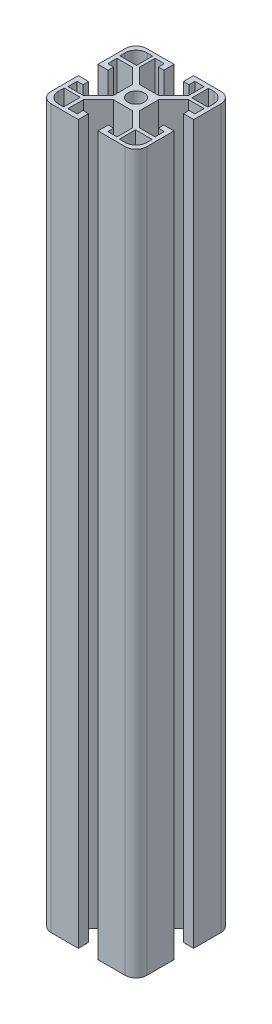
ISO-10303-21;
HEADER;
FILE_DESCRIPTION(('STEP AP214'),'2;1');
FILE_NAME('part.step','',(''),(''),'','','');
FILE_SCHEMA(('AUTOMOTIVE_DESIGN { 1 0 10303 214 1 1 1 1 }'));
ENDSEC;
DATA;
#1=APPLICATION_CONTEXT('core data for automotive mechanical design processes');
#2=APPLICATION_PROTOCOL_DEFINITION('international standard','automotive_design',2000,#1);
#3=PRODUCT_CONTEXT('',#1,'mechanical');
#4=PRODUCT('Part','Part','',(#3));
#5=PRODUCT_RELATED_PRODUCT_CATEGORY('part','',(#4));
#6=PRODUCT_DEFINITION_FORMATION('','',#4);
#7=PRODUCT_DEFINITION_CONTEXT('part definition',#1,'design');
#8=PRODUCT_DEFINITION('design','',#6,#7);
#9=PRODUCT_DEFINITION_SHAPE('','',#8);
#10=(LENGTH_UNIT() NAMED_UNIT(*) SI_UNIT(.MILLI.,.METRE.));
#11=(NAMED_UNIT(*) PLANE_ANGLE_UNIT() SI_UNIT($,.RADIAN.));
#12=(NAMED_UNIT(*) SI_UNIT($,.STERADIAN.) SOLID_ANGLE_UNIT());
#13=UNCERTAINTY_MEASURE_WITH_UNIT(LENGTH_MEASURE(1.E-05),#10,'distance_accuracy_value','');
#14=(GEOMETRIC_REPRESENTATION_CONTEXT(3) GLOBAL_UNCERTAINTY_ASSIGNED_CONTEXT((#13)) GLOBAL_UNIT_ASSIGNED_CONTEXT((#10,
#11,#12)) REPRESENTATION_CONTEXT('',''));
#15=CARTESIAN_POINT('',(0.,0.,0.));
#16=DIRECTION('',(0.,0.,1.));
#17=DIRECTION('',(1.,0.,0.));
#18=AXIS2_PLACEMENT_3D('',#15,#16,#17);
#19=CARTESIAN_POINT('',(0.,300.,0.));
#20=DIRECTION('',(1.,0.,0.));
#21=DIRECTION('',(0.,0.,-1.));
#22=AXIS2_PLACEMENT_3D('',#19,#20,#21);
#23=PLANE('',#22);
#24=DIRECTION('',(0.,0.,1.));
#25=VECTOR('',#24,1.);
#26=CARTESIAN_POINT('',(0.,0.,0.));
#27=LINE('',#26,#25);
#28=CARTESIAN_POINT('',(0.,0.,-15.9000000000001));
#29=VERTEX_POINT('',#28);
#30=CARTESIAN_POINT('',(0.,0.,-4.5));
#31=VERTEX_POINT('',#30);
#32=EDGE_CURVE('E580',#29,#31,#27,.T.);
#33=ORIENTED_EDGE('',*,*,#32,.T.);
#34=DIRECTION('',(0.,-1.,0.));
#35=VECTOR('',#34,1.);
#36=CARTESIAN_POINT('',(0.,300.,-4.5));
#37=LINE('',#36,#35);
#38=CARTESIAN_POINT('',(0.,300.,-4.5));
#39=VERTEX_POINT('',#38);
#40=EDGE_CURVE('E1157',#31,#39,#37,.F.);
#41=ORIENTED_EDGE('',*,*,#40,.T.);
#42=DIRECTION('',(0.,0.,1.));
#43=VECTOR('',#42,1.);
#44=CARTESIAN_POINT('',(0.,300.,0.));
#45=LINE('',#44,#43);
#46=CARTESIAN_POINT('',(0.,300.,-15.9000000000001));
#47=VERTEX_POINT('',#46);
#48=EDGE_CURVE('E1121',#47,#39,#45,.T.);
#49=ORIENTED_EDGE('',*,*,#48,.F.);
#50=DIRECTION('',(0.,1.,0.));
#51=VECTOR('',#50,1.);
#52=CARTESIAN_POINT('',(0.,0.,-15.9000000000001));
#53=LINE('',#52,#51);
#54=EDGE_CURVE('E650',#29,#47,#53,.T.);
#55=ORIENTED_EDGE('',*,*,#54,.F.);
#56=EDGE_LOOP('',(#33,#41,#49,#55));
#57=FACE_BOUND('',#56,.T.);
#58=ADVANCED_FACE('F32',(#57),#23,.F.);
#59=CARTESIAN_POINT('',(0.,300.,0.));
#60=DIRECTION('',(0.,0.,-1.));
#61=DIRECTION('',(-1.,0.,0.));
#62=AXIS2_PLACEMENT_3D('',#59,#60,#61);
#63=PLANE('',#62);
#64=DIRECTION('',(1.,0.,0.));
#65=VECTOR('',#64,1.);
#66=CARTESIAN_POINT('',(0.,0.,0.));
#67=LINE('',#66,#65);
#68=CARTESIAN_POINT('',(24.1,0.,1.38777878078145E-13));
#69=VERTEX_POINT('',#68);
#70=CARTESIAN_POINT('',(35.5,0.,0.));
#71=VERTEX_POINT('',#70);
#72=EDGE_CURVE('E1133',#69,#71,#67,.T.);
#73=ORIENTED_EDGE('',*,*,#72,.T.);
#74=DIRECTION('',(0.,-1.,0.));
#75=VECTOR('',#74,1.);
#76=CARTESIAN_POINT('',(35.5,300.,0.));
#77=LINE('',#76,#75);
#78=CARTESIAN_POINT('',(35.5,300.,0.));
#79=VERTEX_POINT('',#78);
#80=EDGE_CURVE('E55',#71,#79,#77,.F.);
#81=ORIENTED_EDGE('',*,*,#80,.T.);
#82=DIRECTION('',(1.,0.,0.));
#83=VECTOR('',#82,1.);
#84=CARTESIAN_POINT('',(0.,300.,0.));
#85=LINE('',#84,#83);
#86=CARTESIAN_POINT('',(24.1,300.,1.38777878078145E-13));
#87=VERTEX_POINT('',#86);
#88=EDGE_CURVE('E1120',#87,#79,#85,.T.);
#89=ORIENTED_EDGE('',*,*,#88,.F.);
#90=DIRECTION('',(0.,1.,0.));
#91=VECTOR('',#90,1.);
#92=CARTESIAN_POINT('',(24.1,0.,1.38777878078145E-13));
#93=LINE('',#92,#91);
#94=EDGE_CURVE('E785',#69,#87,#93,.T.);
#95=ORIENTED_EDGE('',*,*,#94,.F.);
#96=EDGE_LOOP('',(#73,#81,#89,#95));
#97=FACE_BOUND('',#96,.T.);
#98=ADVANCED_FACE('F1244',(#97),#63,.F.);
#99=CARTESIAN_POINT('',(40.,300.,0.));
#100=DIRECTION('',(-1.,0.,0.));
#101=DIRECTION('',(0.,0.,1.));
#102=AXIS2_PLACEMENT_3D('',#99,#100,#101);
#103=PLANE('',#102);
#104=DIRECTION('',(0.,0.,-1.));
#105=VECTOR('',#104,1.);
#106=CARTESIAN_POINT('',(40.,0.,0.));
#107=LINE('',#106,#105);
#108=CARTESIAN_POINT('',(40.0000000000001,0.,-24.1));
#109=VERTEX_POINT('',#108);
#110=CARTESIAN_POINT('',(40.,0.,-35.5));
#111=VERTEX_POINT('',#110);
#112=EDGE_CURVE('E1136',#109,#111,#107,.T.);
#113=ORIENTED_EDGE('',*,*,#112,.T.);
#114=DIRECTION('',(0.,-1.,0.));
#115=VECTOR('',#114,1.);
#116=CARTESIAN_POINT('',(40.,300.,-35.5));
#117=LINE('',#116,#115);
#118=CARTESIAN_POINT('',(40.,300.,-35.5));
#119=VERTEX_POINT('',#118);
#120=EDGE_CURVE('E1184',#111,#119,#117,.F.);
#121=ORIENTED_EDGE('',*,*,#120,.T.);
#122=DIRECTION('',(0.,0.,-1.));
#123=VECTOR('',#122,1.);
#124=CARTESIAN_POINT('',(40.,300.,0.));
#125=LINE('',#124,#123);
#126=CARTESIAN_POINT('',(40.0000000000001,300.,-24.1));
#127=VERTEX_POINT('',#126);
#128=EDGE_CURVE('E1124',#127,#119,#125,.T.);
#129=ORIENTED_EDGE('',*,*,#128,.F.);
#130=DIRECTION('',(0.,1.,0.));
#131=VECTOR('',#130,1.);
#132=CARTESIAN_POINT('',(40.0000000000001,0.,-24.1));
#133=LINE('',#132,#131);
#134=EDGE_CURVE('E865',#109,#127,#133,.T.);
#135=ORIENTED_EDGE('',*,*,#134,.F.);
#136=EDGE_LOOP('',(#113,#121,#129,#135));
#137=FACE_BOUND('',#136,.T.);
#138=ADVANCED_FACE('F1251',(#137),#103,.F.);
#139=CARTESIAN_POINT('',(0.,300.,-40.));
#140=DIRECTION('',(0.,0.,1.));
#141=DIRECTION('',(1.,0.,0.));
#142=AXIS2_PLACEMENT_3D('',#139,#140,#141);
#143=PLANE('',#142);
#144=DIRECTION('',(-1.,0.,0.));
#145=VECTOR('',#144,1.);
#146=CARTESIAN_POINT('',(0.,0.,-40.));
#147=LINE('',#146,#145);
#148=CARTESIAN_POINT('',(15.9,0.,-40.));
#149=VERTEX_POINT('',#148);
#150=CARTESIAN_POINT('',(4.49999999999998,0.,-40.));
#151=VERTEX_POINT('',#150);
#152=EDGE_CURVE('E1139',#149,#151,#147,.T.);
#153=ORIENTED_EDGE('',*,*,#152,.T.);
#154=DIRECTION('',(0.,-1.,0.));
#155=VECTOR('',#154,1.);
#156=CARTESIAN_POINT('',(4.49999999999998,300.,-40.));
#157=LINE('',#156,#155);
#158=CARTESIAN_POINT('',(4.49999999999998,300.,-40.));
#159=VERTEX_POINT('',#158);
#160=EDGE_CURVE('E1174',#151,#159,#157,.F.);
#161=ORIENTED_EDGE('',*,*,#160,.T.);
#162=DIRECTION('',(-1.,0.,0.));
#163=VECTOR('',#162,1.);
#164=CARTESIAN_POINT('',(0.,300.,-40.));
#165=LINE('',#164,#163);
#166=CARTESIAN_POINT('',(15.9,300.,-40.));
#167=VERTEX_POINT('',#166);
#168=EDGE_CURVE('E1127',#167,#159,#165,.T.);
#169=ORIENTED_EDGE('',*,*,#168,.F.);
#170=DIRECTION('',(0.,1.,0.));
#171=VECTOR('',#170,1.);
#172=CARTESIAN_POINT('',(15.9,0.,-40.));
#173=LINE('',#172,#171);
#174=EDGE_CURVE('E1090',#149,#167,#173,.T.);
#175=ORIENTED_EDGE('',*,*,#174,.F.);
#176=EDGE_LOOP('',(#153,#161,#169,#175));
#177=FACE_BOUND('',#176,.T.);
#178=ADVANCED_FACE('F1256',(#177),#143,.F.);
#179=CARTESIAN_POINT('',(0.,300.,-35.5));
#180=VERTEX_POINT('',#179);
#181=CARTESIAN_POINT('',(0.,300.,-24.1000000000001));
#182=VERTEX_POINT('',#181);
#183=EDGE_CURVE('E1118',#180,#182,#45,.T.);
#184=ORIENTED_EDGE('',*,*,#183,.F.);
#185=DIRECTION('',(0.,-1.,0.));
#186=VECTOR('',#185,1.);
#187=CARTESIAN_POINT('',(0.,300.,-35.5));
#188=LINE('',#187,#186);
#189=CARTESIAN_POINT('',(0.,0.,-35.5));
#190=VERTEX_POINT('',#189);
#191=EDGE_CURVE('E1171',#180,#190,#188,.T.);
#192=ORIENTED_EDGE('',*,*,#191,.T.);
#193=CARTESIAN_POINT('',(0.,0.,-24.1000000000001));
#194=VERTEX_POINT('',#193);
#195=EDGE_CURVE('E1131',#190,#194,#27,.T.);
#196=ORIENTED_EDGE('',*,*,#195,.T.);
#197=DIRECTION('',(0.,1.,0.));
#198=VECTOR('',#197,1.);
#199=CARTESIAN_POINT('',(0.,0.,-24.1000000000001));
#200=LINE('',#199,#198);
#201=EDGE_CURVE('E653',#194,#182,#200,.T.);
#202=ORIENTED_EDGE('',*,*,#201,.T.);
#203=EDGE_LOOP('',(#184,#192,#196,#202));
#204=FACE_BOUND('',#203,.T.);
#205=ADVANCED_FACE('F1247',(#204),#23,.F.);
#206=CARTESIAN_POINT('',(4.5,300.,0.));
#207=VERTEX_POINT('',#206);
#208=CARTESIAN_POINT('',(15.9,300.,0.));
#209=VERTEX_POINT('',#208);
#210=EDGE_CURVE('E1122',#207,#209,#85,.T.);
#211=ORIENTED_EDGE('',*,*,#210,.F.);
#212=DIRECTION('',(0.,-1.,0.));
#213=VECTOR('',#212,1.);
#214=CARTESIAN_POINT('',(4.5,300.,0.));
#215=LINE('',#214,#213);
#216=CARTESIAN_POINT('',(4.5,0.,0.));
#217=VERTEX_POINT('',#216);
#218=EDGE_CURVE('E1146',#207,#217,#215,.T.);
#219=ORIENTED_EDGE('',*,*,#218,.T.);
#220=CARTESIAN_POINT('',(15.9,0.,0.));
#221=VERTEX_POINT('',#220);
#222=EDGE_CURVE('E1134',#217,#221,#67,.T.);
#223=ORIENTED_EDGE('',*,*,#222,.T.);
#224=DIRECTION('',(0.,1.,0.));
#225=VECTOR('',#224,1.);
#226=CARTESIAN_POINT('',(15.9,0.,0.));
#227=LINE('',#226,#225);
#228=EDGE_CURVE('E788',#221,#209,#227,.T.);
#229=ORIENTED_EDGE('',*,*,#228,.T.);
#230=EDGE_LOOP('',(#211,#219,#223,#229));
#231=FACE_BOUND('',#230,.T.);
#232=ADVANCED_FACE('F1253',(#231),#63,.F.);
#233=CARTESIAN_POINT('',(40.,300.,-4.5));
#234=VERTEX_POINT('',#233);
#235=CARTESIAN_POINT('',(40.0000000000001,300.,-15.9));
#236=VERTEX_POINT('',#235);
#237=EDGE_CURVE('E1125',#234,#236,#125,.T.);
#238=ORIENTED_EDGE('',*,*,#237,.F.);
#239=DIRECTION('',(0.,-1.,0.));
#240=VECTOR('',#239,1.);
#241=CARTESIAN_POINT('',(40.,300.,-4.5));
#242=LINE('',#241,#240);
#243=CARTESIAN_POINT('',(40.,0.,-4.5));
#244=VERTEX_POINT('',#243);
#245=EDGE_CURVE('E1186',#234,#244,#242,.T.);
#246=ORIENTED_EDGE('',*,*,#245,.T.);
#247=CARTESIAN_POINT('',(40.0000000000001,0.,-15.9));
#248=VERTEX_POINT('',#247);
#249=EDGE_CURVE('E1137',#244,#248,#107,.T.);
#250=ORIENTED_EDGE('',*,*,#249,.T.);
#251=DIRECTION('',(0.,1.,0.));
#252=VECTOR('',#251,1.);
#253=CARTESIAN_POINT('',(40.0000000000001,0.,-15.9));
#254=LINE('',#253,#252);
#255=EDGE_CURVE('E959',#248,#236,#254,.T.);
#256=ORIENTED_EDGE('',*,*,#255,.T.);
#257=EDGE_LOOP('',(#238,#246,#250,#256));
#258=FACE_BOUND('',#257,.T.);
#259=ADVANCED_FACE('F1262',(#258),#103,.F.);
#260=CARTESIAN_POINT('',(35.5,300.,-40.));
#261=VERTEX_POINT('',#260);
#262=CARTESIAN_POINT('',(24.1,300.,-40.));
#263=VERTEX_POINT('',#262);
#264=EDGE_CURVE('E1128',#261,#263,#165,.T.);
#265=ORIENTED_EDGE('',*,*,#264,.F.);
#266=DIRECTION('',(0.,-1.,0.));
#267=VECTOR('',#266,1.);
#268=CARTESIAN_POINT('',(35.5,300.,-40.));
#269=LINE('',#268,#267);
#270=CARTESIAN_POINT('',(35.5,0.,-40.));
#271=VERTEX_POINT('',#270);
#272=EDGE_CURVE('E1181',#261,#271,#269,.T.);
#273=ORIENTED_EDGE('',*,*,#272,.T.);
#274=CARTESIAN_POINT('',(24.1,0.,-40.));
#275=VERTEX_POINT('',#274);
#276=EDGE_CURVE('E1140',#271,#275,#147,.T.);
#277=ORIENTED_EDGE('',*,*,#276,.T.);
#278=DIRECTION('',(0.,1.,0.));
#279=VECTOR('',#278,1.);
#280=CARTESIAN_POINT('',(24.1,0.,-40.));
#281=LINE('',#280,#279);
#282=EDGE_CURVE('E1092',#275,#263,#281,.T.);
#283=ORIENTED_EDGE('',*,*,#282,.T.);
#284=EDGE_LOOP('',(#265,#273,#277,#283));
#285=FACE_BOUND('',#284,.T.);
#286=ADVANCED_FACE('F1266',(#285),#143,.F.);
#287=CARTESIAN_POINT('',(0.,300.,0.));
#288=DIRECTION('',(0.,-1.,0.));
#289=DIRECTION('',(0.,0.,-1.));
#290=AXIS2_PLACEMENT_3D('',#287,#288,#289);
#291=PLANE('',#290);
#292=CARTESIAN_POINT('',(20.,300.,-20.));
#293=DIRECTION('',(0.,1.,0.));
#294=DIRECTION('',(0.,0.,1.));
#295=AXIS2_PLACEMENT_3D('',#292,#293,#294);
#296=CIRCLE('',#295,3.4);
#297=CARTESIAN_POINT('',(20.,300.,-16.6));
#298=VERTEX_POINT('',#297);
#299=EDGE_CURVE('E845',#298,#298,#296,.T.);
#300=ORIENTED_EDGE('',*,*,#299,.F.);
#301=EDGE_LOOP('',(#300));
#302=FACE_BOUND('',#301,.T.);
#303=DIRECTION('',(-1.,0.,0.));
#304=VECTOR('',#303,1.);
#305=CARTESIAN_POINT('',(8.44999999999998,300.,-38.5));
#306=LINE('',#305,#304);
#307=CARTESIAN_POINT('',(8.44999999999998,300.,-38.5));
#308=VERTEX_POINT('',#307);
#309=CARTESIAN_POINT('',(5.99999999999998,300.,-38.5));
#310=VERTEX_POINT('',#309);
#311=EDGE_CURVE('E864',#308,#310,#306,.T.);
#312=ORIENTED_EDGE('',*,*,#311,.F.);
#313=DIRECTION('',(0.,0.,-1.));
#314=VECTOR('',#313,1.);
#315=CARTESIAN_POINT('',(8.44999999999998,300.,-31.75));
#316=LINE('',#315,#314);
#317=CARTESIAN_POINT('',(8.44999999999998,300.,-31.75));
#318=VERTEX_POINT('',#317);
#319=EDGE_CURVE('E862',#318,#308,#316,.T.);
#320=ORIENTED_EDGE('',*,*,#319,.F.);
#321=DIRECTION('',(1.,0.,0.));
#322=VECTOR('',#321,1.);
#323=CARTESIAN_POINT('',(8.44999999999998,300.,-31.75));
#324=LINE('',#323,#322);
#325=CARTESIAN_POINT('',(1.49999999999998,300.,-31.75));
#326=VERTEX_POINT('',#325);
#327=EDGE_CURVE('E853',#326,#318,#324,.T.);
#328=ORIENTED_EDGE('',*,*,#327,.F.);
#329=DIRECTION('',(0.,0.,1.));
#330=VECTOR('',#329,1.);
#331=CARTESIAN_POINT('',(1.49999999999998,300.,-31.75));
#332=LINE('',#331,#330);
#333=CARTESIAN_POINT('',(1.49999999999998,300.,-34.));
#334=VERTEX_POINT('',#333);
#335=EDGE_CURVE('E868',#334,#326,#332,.T.);
#336=ORIENTED_EDGE('',*,*,#335,.F.);
#337=CARTESIAN_POINT('',(5.99999999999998,300.,-34.));
#338=DIRECTION('',(0.,-1.,0.));
#339=DIRECTION('',(0.,0.,-1.));
#340=AXIS2_PLACEMENT_3D('',#337,#338,#339);
#341=CIRCLE('',#340,4.5);
#342=EDGE_CURVE('E1199',#334,#310,#341,.T.);
#343=ORIENTED_EDGE('',*,*,#342,.T.);
#344=EDGE_LOOP('',(#312,#320,#328,#336,#343));
#345=FACE_BOUND('',#344,.T.);
#346=DIRECTION('',(0.,0.,-1.));
#347=VECTOR('',#346,1.);
#348=CARTESIAN_POINT('',(38.5000000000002,300.,-31.55));
#349=LINE('',#348,#347);
#350=CARTESIAN_POINT('',(38.5000000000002,300.,-31.55));
#351=VERTEX_POINT('',#350);
#352=CARTESIAN_POINT('',(38.5000000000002,300.,-34.));
#353=VERTEX_POINT('',#352);
#354=EDGE_CURVE('E999',#351,#353,#349,.T.);
#355=ORIENTED_EDGE('',*,*,#354,.F.);
#356=DIRECTION('',(1.,0.,0.));
#357=VECTOR('',#356,1.);
#358=CARTESIAN_POINT('',(31.7500000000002,300.,-31.55));
#359=LINE('',#358,#357);
#360=CARTESIAN_POINT('',(31.7500000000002,300.,-31.55));
#361=VERTEX_POINT('',#360);
#362=EDGE_CURVE('E787',#361,#351,#359,.T.);
#363=ORIENTED_EDGE('',*,*,#362,.F.);
#364=DIRECTION('',(0.,0.,1.));
#365=VECTOR('',#364,1.);
#366=CARTESIAN_POINT('',(31.7500000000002,300.,-31.55));
#367=LINE('',#366,#365);
#368=CARTESIAN_POINT('',(31.7500000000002,300.,-38.5));
#369=VERTEX_POINT('',#368);
#370=EDGE_CURVE('E989',#369,#361,#367,.T.);
#371=ORIENTED_EDGE('',*,*,#370,.F.);
#372=DIRECTION('',(-1.,0.,0.));
#373=VECTOR('',#372,1.);
#374=CARTESIAN_POINT('',(31.7500000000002,300.,-38.5));
#375=LINE('',#374,#373);
#376=CARTESIAN_POINT('',(34.0000000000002,300.,-38.5));
#377=VERTEX_POINT('',#376);
#378=EDGE_CURVE('E1002',#377,#369,#375,.T.);
#379=ORIENTED_EDGE('',*,*,#378,.F.);
#380=CARTESIAN_POINT('',(34.0000000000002,300.,-34.));
#381=DIRECTION('',(0.,-1.,0.));
#382=DIRECTION('',(0.,0.,-1.));
#383=AXIS2_PLACEMENT_3D('',#380,#381,#382);
#384=CIRCLE('',#383,4.5);
#385=EDGE_CURVE('E1203',#377,#353,#384,.T.);
#386=ORIENTED_EDGE('',*,*,#385,.T.);
#387=EDGE_LOOP('',(#355,#363,#371,#379,#386));
#388=FACE_BOUND('',#387,.T.);
#389=DIRECTION('',(0.,0.,1.));
#390=VECTOR('',#389,1.);
#391=CARTESIAN_POINT('',(1.49999999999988,300.,-8.45000000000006));
#392=LINE('',#391,#390);
#393=CARTESIAN_POINT('',(1.49999999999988,300.,-8.45000000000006));
#394=VERTEX_POINT('',#393);
#395=CARTESIAN_POINT('',(1.49999999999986,300.,-6.00000000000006));
#396=VERTEX_POINT('',#395);
#397=EDGE_CURVE('E692',#394,#396,#392,.T.);
#398=ORIENTED_EDGE('',*,*,#397,.F.);
#399=DIRECTION('',(-1.,0.,0.));
#400=VECTOR('',#399,1.);
#401=CARTESIAN_POINT('',(8.24999999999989,300.,-8.44999999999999));
#402=LINE('',#401,#400);
#403=CARTESIAN_POINT('',(8.24999999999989,300.,-8.44999999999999));
#404=VERTEX_POINT('',#403);
#405=EDGE_CURVE('E690',#404,#394,#402,.T.);
#406=ORIENTED_EDGE('',*,*,#405,.F.);
#407=DIRECTION('',(0.,0.,-1.));
#408=VECTOR('',#407,1.);
#409=CARTESIAN_POINT('',(8.24999999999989,300.,-8.44999999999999));
#410=LINE('',#409,#408);
#411=CARTESIAN_POINT('',(8.24999999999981,300.,-1.49999999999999));
#412=VERTEX_POINT('',#411);
#413=EDGE_CURVE('E681',#412,#404,#410,.T.);
#414=ORIENTED_EDGE('',*,*,#413,.F.);
#415=DIRECTION('',(1.,0.,0.));
#416=VECTOR('',#415,1.);
#417=CARTESIAN_POINT('',(8.24999999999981,300.,-1.49999999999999));
#418=LINE('',#417,#416);
#419=CARTESIAN_POINT('',(5.99999999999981,300.,-1.50000000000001));
#420=VERTEX_POINT('',#419);
#421=EDGE_CURVE('E695',#420,#412,#418,.T.);
#422=ORIENTED_EDGE('',*,*,#421,.F.);
#423=CARTESIAN_POINT('',(5.99999999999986,300.,-6.00000000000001));
#424=DIRECTION('',(0.,-1.,0.));
#425=DIRECTION('',(0.,0.,-1.));
#426=AXIS2_PLACEMENT_3D('',#423,#424,#425);
#427=CIRCLE('',#426,4.5);
#428=EDGE_CURVE('E1195',#420,#396,#427,.T.);
#429=ORIENTED_EDGE('',*,*,#428,.T.);
#430=EDGE_LOOP('',(#398,#406,#414,#422,#429));
#431=FACE_BOUND('',#430,.T.);
#432=DIRECTION('',(1.,0.,0.));
#433=VECTOR('',#432,1.);
#434=CARTESIAN_POINT('',(31.55,300.,-1.49999999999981));
#435=LINE('',#434,#433);
#436=CARTESIAN_POINT('',(31.55,300.,-1.49999999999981));
#437=VERTEX_POINT('',#436);
#438=CARTESIAN_POINT('',(34.,300.,-1.4999999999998));
#439=VERTEX_POINT('',#438);
#440=EDGE_CURVE('E828',#437,#439,#435,.T.);
#441=ORIENTED_EDGE('',*,*,#440,.F.);
#442=DIRECTION('',(0.,0.,1.));
#443=VECTOR('',#442,1.);
#444=CARTESIAN_POINT('',(31.5500000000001,300.,-8.24999999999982));
#445=LINE('',#444,#443);
#446=CARTESIAN_POINT('',(31.5500000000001,300.,-8.24999999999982));
#447=VERTEX_POINT('',#446);
#448=EDGE_CURVE('E652',#447,#437,#445,.T.);
#449=ORIENTED_EDGE('',*,*,#448,.F.);
#450=DIRECTION('',(-1.,0.,0.));
#451=VECTOR('',#450,1.);
#452=CARTESIAN_POINT('',(31.5500000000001,300.,-8.24999999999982));
#453=LINE('',#452,#451);
#454=CARTESIAN_POINT('',(38.5000000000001,300.,-8.24999999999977));
#455=VERTEX_POINT('',#454);
#456=EDGE_CURVE('E818',#455,#447,#453,.T.);
#457=ORIENTED_EDGE('',*,*,#456,.F.);
#458=DIRECTION('',(0.,0.,-1.));
#459=VECTOR('',#458,1.);
#460=CARTESIAN_POINT('',(38.5000000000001,300.,-8.24999999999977));
#461=LINE('',#460,#459);
#462=CARTESIAN_POINT('',(38.5000000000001,300.,-5.99999999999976));
#463=VERTEX_POINT('',#462);
#464=EDGE_CURVE('E831',#463,#455,#461,.T.);
#465=ORIENTED_EDGE('',*,*,#464,.F.);
#466=CARTESIAN_POINT('',(34.0000000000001,300.,-5.9999999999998));
#467=DIRECTION('',(0.,-1.,0.));
#468=DIRECTION('',(0.,0.,-1.));
#469=AXIS2_PLACEMENT_3D('',#466,#467,#468);
#470=CIRCLE('',#469,4.5);
#471=EDGE_CURVE('E40',#463,#439,#470,.T.);
#472=ORIENTED_EDGE('',*,*,#471,.T.);
#473=EDGE_LOOP('',(#441,#449,#457,#465,#472));
#474=FACE_BOUND('',#473,.T.);
#475=ORIENTED_EDGE('',*,*,#48,.T.);
#476=CARTESIAN_POINT('',(4.5,300.,-4.5));
#477=DIRECTION('',(0.,-1.,0.));
#478=DIRECTION('',(0.,0.,-1.));
#479=AXIS2_PLACEMENT_3D('',#476,#477,#478);
#480=CIRCLE('',#479,4.5);
#481=EDGE_CURVE('E1164',#39,#207,#480,.F.);
#482=ORIENTED_EDGE('',*,*,#481,.T.);
#483=ORIENTED_EDGE('',*,*,#210,.T.);
#484=DIRECTION('',(0.,0.,1.));
#485=VECTOR('',#484,1.);
#486=CARTESIAN_POINT('',(15.9,300.,0.));
#487=LINE('',#486,#485);
#488=CARTESIAN_POINT('',(15.9,300.,-4.24999999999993));
#489=VERTEX_POINT('',#488);
#490=EDGE_CURVE('E709',#489,#209,#487,.T.);
#491=ORIENTED_EDGE('',*,*,#490,.F.);
#492=DIRECTION('',(1.,0.,0.));
#493=VECTOR('',#492,1.);
#494=CARTESIAN_POINT('',(15.9,300.,-4.24999999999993));
#495=LINE('',#494,#493);
#496=CARTESIAN_POINT('',(13.6,300.,-4.24999999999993));
#497=VERTEX_POINT('',#496);
#498=EDGE_CURVE('E780',#497,#489,#495,.T.);
#499=ORIENTED_EDGE('',*,*,#498,.F.);
#500=DIRECTION('',(0.,0.,-1.));
#501=VECTOR('',#500,1.);
#502=CARTESIAN_POINT('',(13.6,300.,-4.24999999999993));
#503=LINE('',#502,#501);
#504=CARTESIAN_POINT('',(13.6,300.,-1.79999999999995));
#505=VERTEX_POINT('',#504);
#506=EDGE_CURVE('E777',#505,#497,#503,.T.);
#507=ORIENTED_EDGE('',*,*,#506,.F.);
#508=DIRECTION('',(1.,0.,0.));
#509=VECTOR('',#508,1.);
#510=CARTESIAN_POINT('',(13.6,300.,-1.79999999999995));
#511=LINE('',#510,#509);
#512=CARTESIAN_POINT('',(9.75000000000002,300.,-1.79999999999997));
#513=VERTEX_POINT('',#512);
#514=EDGE_CURVE('E774',#513,#505,#511,.T.);
#515=ORIENTED_EDGE('',*,*,#514,.F.);
#516=DIRECTION('',(0.,0.,1.));
#517=VECTOR('',#516,1.);
#518=CARTESIAN_POINT('',(9.75000000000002,300.,-1.79999999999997));
#519=LINE('',#518,#517);
#520=CARTESIAN_POINT('',(9.75000000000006,300.,-8.24999999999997));
#521=VERTEX_POINT('',#520);
#522=EDGE_CURVE('E771',#521,#513,#519,.T.);
#523=ORIENTED_EDGE('',*,*,#522,.F.);
#524=DIRECTION('',(-0.707106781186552,0.,0.707106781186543));
#525=VECTOR('',#524,1.);
#526=CARTESIAN_POINT('',(9.75000000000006,300.,-8.24999999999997));
#527=LINE('',#526,#525);
#528=CARTESIAN_POINT('',(16.0000000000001,300.,-14.4999999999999));
#529=VERTEX_POINT('',#528);
#530=EDGE_CURVE('E768',#529,#521,#527,.T.);
#531=ORIENTED_EDGE('',*,*,#530,.F.);
#532=DIRECTION('',(-1.,0.,0.));
#533=VECTOR('',#532,1.);
#534=CARTESIAN_POINT('',(24.0000000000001,300.,-14.4999999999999));
#535=LINE('',#534,#533);
#536=CARTESIAN_POINT('',(24.0000000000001,300.,-14.4999999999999));
#537=VERTEX_POINT('',#536);
#538=EDGE_CURVE('E765',#537,#529,#535,.T.);
#539=ORIENTED_EDGE('',*,*,#538,.F.);
#540=DIRECTION('',(-0.707106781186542,0.,-0.707106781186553));
#541=VECTOR('',#540,1.);
#542=CARTESIAN_POINT('',(30.2500000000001,300.,-8.24999999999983));
#543=LINE('',#542,#541);
#544=CARTESIAN_POINT('',(30.2500000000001,300.,-8.24999999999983));
#545=VERTEX_POINT('',#544);
#546=EDGE_CURVE('E762',#545,#537,#543,.T.);
#547=ORIENTED_EDGE('',*,*,#546,.F.);
#548=DIRECTION('',(0.,0.,-1.));
#549=VECTOR('',#548,1.);
#550=CARTESIAN_POINT('',(30.25,300.,-1.79999999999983));
#551=LINE('',#550,#549);
#552=CARTESIAN_POINT('',(30.25,300.,-1.79999999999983));
#553=VERTEX_POINT('',#552);
#554=EDGE_CURVE('E759',#553,#545,#551,.T.);
#555=ORIENTED_EDGE('',*,*,#554,.F.);
#556=DIRECTION('',(1.,0.,0.));
#557=VECTOR('',#556,1.);
#558=CARTESIAN_POINT('',(26.4,300.,-1.79999999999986));
#559=LINE('',#558,#557);
#560=CARTESIAN_POINT('',(26.4,300.,-1.79999999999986));
#561=VERTEX_POINT('',#560);
#562=EDGE_CURVE('E756',#561,#553,#559,.T.);
#563=ORIENTED_EDGE('',*,*,#562,.F.);
#564=DIRECTION('',(0.,0.,1.));
#565=VECTOR('',#564,1.);
#566=CARTESIAN_POINT('',(26.4,300.,-4.24999999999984));
#567=LINE('',#566,#565);
#568=CARTESIAN_POINT('',(26.4,300.,-4.24999999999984));
#569=VERTEX_POINT('',#568);
#570=EDGE_CURVE('E753',#569,#561,#567,.T.);
#571=ORIENTED_EDGE('',*,*,#570,.F.);
#572=DIRECTION('',(1.,0.,0.));
#573=VECTOR('',#572,1.);
#574=CARTESIAN_POINT('',(24.1,300.,-4.24999999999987));
#575=LINE('',#574,#573);
#576=CARTESIAN_POINT('',(24.1,300.,-4.24999999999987));
#577=VERTEX_POINT('',#576);
#578=EDGE_CURVE('E749',#577,#569,#575,.T.);
#579=ORIENTED_EDGE('',*,*,#578,.F.);
#580=DIRECTION('',(0.,0.,-1.));
#581=VECTOR('',#580,1.);
#582=CARTESIAN_POINT('',(24.1,300.,1.38777878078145E-13));
#583=LINE('',#582,#581);
#584=EDGE_CURVE('E746',#87,#577,#583,.T.);
#585=ORIENTED_EDGE('',*,*,#584,.F.);
#586=ORIENTED_EDGE('',*,*,#88,.T.);
#587=CARTESIAN_POINT('',(35.5,300.,-4.5));
#588=DIRECTION('',(0.,-1.,0.));
#589=DIRECTION('',(0.,0.,-1.));
#590=AXIS2_PLACEMENT_3D('',#587,#588,#589);
#591=CIRCLE('',#590,4.5);
#592=EDGE_CURVE('E47',#79,#234,#591,.F.);
#593=ORIENTED_EDGE('',*,*,#592,.T.);
#594=ORIENTED_EDGE('',*,*,#237,.T.);
#595=DIRECTION('',(1.,0.,0.));
#596=VECTOR('',#595,1.);
#597=CARTESIAN_POINT('',(40.0000000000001,300.,-15.9));
#598=LINE('',#597,#596);
#599=CARTESIAN_POINT('',(35.7500000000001,300.,-15.9));
#600=VERTEX_POINT('',#599);
#601=EDGE_CURVE('E882',#600,#236,#598,.T.);
#602=ORIENTED_EDGE('',*,*,#601,.F.);
#603=DIRECTION('',(0.,0.,-1.));
#604=VECTOR('',#603,1.);
#605=CARTESIAN_POINT('',(35.7500000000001,300.,-15.9));
#606=LINE('',#605,#604);
#607=CARTESIAN_POINT('',(35.7500000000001,300.,-13.6));
#608=VERTEX_POINT('',#607);
#609=EDGE_CURVE('E953',#608,#600,#606,.T.);
#610=ORIENTED_EDGE('',*,*,#609,.F.);
#611=DIRECTION('',(-1.,0.,0.));
#612=VECTOR('',#611,1.);
#613=CARTESIAN_POINT('',(35.7500000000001,300.,-13.6));
#614=LINE('',#613,#612);
#615=CARTESIAN_POINT('',(38.2000000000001,300.,-13.6));
#616=VERTEX_POINT('',#615);
#617=EDGE_CURVE('E950',#616,#608,#614,.T.);
#618=ORIENTED_EDGE('',*,*,#617,.F.);
#619=DIRECTION('',(0.,0.,-1.));
#620=VECTOR('',#619,1.);
#621=CARTESIAN_POINT('',(38.2000000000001,300.,-13.6));
#622=LINE('',#621,#620);
#623=CARTESIAN_POINT('',(38.2000000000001,300.,-9.74999999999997));
#624=VERTEX_POINT('',#623);
#625=EDGE_CURVE('E947',#624,#616,#622,.T.);
#626=ORIENTED_EDGE('',*,*,#625,.F.);
#627=DIRECTION('',(1.,0.,0.));
#628=VECTOR('',#627,1.);
#629=CARTESIAN_POINT('',(38.2000000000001,300.,-9.74999999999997));
#630=LINE('',#629,#628);
#631=CARTESIAN_POINT('',(31.7500000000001,300.,-9.74999999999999));
#632=VERTEX_POINT('',#631);
#633=EDGE_CURVE('E944',#632,#624,#630,.T.);
#634=ORIENTED_EDGE('',*,*,#633,.F.);
#635=DIRECTION('',(0.707106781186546,0.,0.707106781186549));
#636=VECTOR('',#635,1.);
#637=CARTESIAN_POINT('',(31.7500000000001,300.,-9.74999999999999));
#638=LINE('',#637,#636);
#639=CARTESIAN_POINT('',(25.5000000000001,300.,-16.));
#640=VERTEX_POINT('',#639);
#641=EDGE_CURVE('E941',#640,#632,#638,.T.);
#642=ORIENTED_EDGE('',*,*,#641,.F.);
#643=DIRECTION('',(0.,0.,1.));
#644=VECTOR('',#643,1.);
#645=CARTESIAN_POINT('',(25.5000000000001,300.,-24.));
#646=LINE('',#645,#644);
#647=CARTESIAN_POINT('',(25.5000000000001,300.,-24.));
#648=VERTEX_POINT('',#647);
#649=EDGE_CURVE('E938',#648,#640,#646,.T.);
#650=ORIENTED_EDGE('',*,*,#649,.F.);
#651=DIRECTION('',(-0.70710678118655,0.,0.707106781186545));
#652=VECTOR('',#651,1.);
#653=CARTESIAN_POINT('',(31.7500000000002,300.,-30.25));
#654=LINE('',#653,#652);
#655=CARTESIAN_POINT('',(31.7500000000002,300.,-30.25));
#656=VERTEX_POINT('',#655);
#657=EDGE_CURVE('E935',#656,#648,#654,.T.);
#658=ORIENTED_EDGE('',*,*,#657,.F.);
#659=DIRECTION('',(-1.,0.,0.));
#660=VECTOR('',#659,1.);
#661=CARTESIAN_POINT('',(38.2000000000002,300.,-30.25));
#662=LINE('',#661,#660);
#663=CARTESIAN_POINT('',(38.2000000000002,300.,-30.25));
#664=VERTEX_POINT('',#663);
#665=EDGE_CURVE('E932',#664,#656,#662,.T.);
#666=ORIENTED_EDGE('',*,*,#665,.F.);
#667=DIRECTION('',(0.,0.,-1.));
#668=VECTOR('',#667,1.);
#669=CARTESIAN_POINT('',(38.2000000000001,300.,-26.4));
#670=LINE('',#669,#668);
#671=CARTESIAN_POINT('',(38.2000000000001,300.,-26.4));
#672=VERTEX_POINT('',#671);
#673=EDGE_CURVE('E929',#672,#664,#670,.T.);
#674=ORIENTED_EDGE('',*,*,#673,.F.);
#675=DIRECTION('',(1.,0.,0.));
#676=VECTOR('',#675,1.);
#677=CARTESIAN_POINT('',(35.7500000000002,300.,-26.4));
#678=LINE('',#677,#676);
#679=CARTESIAN_POINT('',(35.7500000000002,300.,-26.4));
#680=VERTEX_POINT('',#679);
#681=EDGE_CURVE('E926',#680,#672,#678,.T.);
#682=ORIENTED_EDGE('',*,*,#681,.F.);
#683=DIRECTION('',(0.,0.,-1.));
#684=VECTOR('',#683,1.);
#685=CARTESIAN_POINT('',(35.7500000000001,300.,-24.1));
#686=LINE('',#685,#684);
#687=CARTESIAN_POINT('',(35.7500000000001,300.,-24.1));
#688=VERTEX_POINT('',#687);
#689=EDGE_CURVE('E922',#688,#680,#686,.T.);
#690=ORIENTED_EDGE('',*,*,#689,.F.);
#691=DIRECTION('',(-1.,0.,0.));
#692=VECTOR('',#691,1.);
#693=CARTESIAN_POINT('',(40.0000000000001,300.,-24.1));
#694=LINE('',#693,#692);
#695=EDGE_CURVE('E919',#127,#688,#694,.T.);
#696=ORIENTED_EDGE('',*,*,#695,.F.);
#697=ORIENTED_EDGE('',*,*,#128,.T.);
#698=CARTESIAN_POINT('',(35.5,300.,-35.5));
#699=DIRECTION('',(0.,-1.,0.));
#700=DIRECTION('',(0.,0.,-1.));
#701=AXIS2_PLACEMENT_3D('',#698,#699,#700);
#702=CIRCLE('',#701,4.5);
#703=EDGE_CURVE('E1160',#119,#261,#702,.F.);
#704=ORIENTED_EDGE('',*,*,#703,.T.);
#705=ORIENTED_EDGE('',*,*,#264,.T.);
#706=DIRECTION('',(0.,0.,-1.));
#707=VECTOR('',#706,1.);
#708=CARTESIAN_POINT('',(24.1,300.,-40.));
#709=LINE('',#708,#707);
#710=CARTESIAN_POINT('',(24.1,300.,-35.75));
#711=VERTEX_POINT('',#710);
#712=EDGE_CURVE('E1016',#711,#263,#709,.T.);
#713=ORIENTED_EDGE('',*,*,#712,.F.);
#714=DIRECTION('',(-1.,0.,0.));
#715=VECTOR('',#714,1.);
#716=CARTESIAN_POINT('',(24.1,300.,-35.75));
#717=LINE('',#716,#715);
#718=CARTESIAN_POINT('',(26.4,300.,-35.75));
#719=VERTEX_POINT('',#718);
#720=EDGE_CURVE('E1085',#719,#711,#717,.T.);
#721=ORIENTED_EDGE('',*,*,#720,.F.);
#722=DIRECTION('',(0.,0.,1.));
#723=VECTOR('',#722,1.);
#724=CARTESIAN_POINT('',(26.4,300.,-35.75));
#725=LINE('',#724,#723);
#726=CARTESIAN_POINT('',(26.4,300.,-38.2));
#727=VERTEX_POINT('',#726);
#728=EDGE_CURVE('E1082',#727,#719,#725,.T.);
#729=ORIENTED_EDGE('',*,*,#728,.F.);
#730=DIRECTION('',(-1.,0.,0.));
#731=VECTOR('',#730,1.);
#732=CARTESIAN_POINT('',(26.4,300.,-38.2));
#733=LINE('',#732,#731);
#734=CARTESIAN_POINT('',(30.25,300.,-38.2));
#735=VERTEX_POINT('',#734);
#736=EDGE_CURVE('E1079',#735,#727,#733,.T.);
#737=ORIENTED_EDGE('',*,*,#736,.F.);
#738=DIRECTION('',(0.,0.,-1.));
#739=VECTOR('',#738,1.);
#740=CARTESIAN_POINT('',(30.25,300.,-38.2));
#741=LINE('',#740,#739);
#742=CARTESIAN_POINT('',(30.25,300.,-31.75));
#743=VERTEX_POINT('',#742);
#744=EDGE_CURVE('E1076',#743,#735,#741,.T.);
#745=ORIENTED_EDGE('',*,*,#744,.F.);
#746=DIRECTION('',(0.707106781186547,0.,-0.707106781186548));
#747=VECTOR('',#746,1.);
#748=CARTESIAN_POINT('',(30.25,300.,-31.75));
#749=LINE('',#748,#747);
#750=CARTESIAN_POINT('',(24.,300.,-25.5));
#751=VERTEX_POINT('',#750);
#752=EDGE_CURVE('E1073',#751,#743,#749,.T.);
#753=ORIENTED_EDGE('',*,*,#752,.F.);
#754=DIRECTION('',(1.,0.,0.));
#755=VECTOR('',#754,1.);
#756=CARTESIAN_POINT('',(16.,300.,-25.5));
#757=LINE('',#756,#755);
#758=CARTESIAN_POINT('',(16.,300.,-25.5));
#759=VERTEX_POINT('',#758);
#760=EDGE_CURVE('E1070',#759,#751,#757,.T.);
#761=ORIENTED_EDGE('',*,*,#760,.F.);
#762=DIRECTION('',(0.707106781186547,0.,0.707106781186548));
#763=VECTOR('',#762,1.);
#764=CARTESIAN_POINT('',(9.74999999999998,300.,-31.75));
#765=LINE('',#764,#763);
#766=CARTESIAN_POINT('',(9.74999999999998,300.,-31.75));
#767=VERTEX_POINT('',#766);
#768=EDGE_CURVE('E1067',#767,#759,#765,.T.);
#769=ORIENTED_EDGE('',*,*,#768,.F.);
#770=DIRECTION('',(0.,0.,1.));
#771=VECTOR('',#770,1.);
#772=CARTESIAN_POINT('',(9.74999999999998,300.,-38.2));
#773=LINE('',#772,#771);
#774=CARTESIAN_POINT('',(9.74999999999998,300.,-38.2));
#775=VERTEX_POINT('',#774);
#776=EDGE_CURVE('E1064',#775,#767,#773,.T.);
#777=ORIENTED_EDGE('',*,*,#776,.F.);
#778=DIRECTION('',(-1.,0.,0.));
#779=VECTOR('',#778,1.);
#780=CARTESIAN_POINT('',(13.6,300.,-38.2));
#781=LINE('',#780,#779);
#782=CARTESIAN_POINT('',(13.6,300.,-38.2));
#783=VERTEX_POINT('',#782);
#784=EDGE_CURVE('E1061',#783,#775,#781,.T.);
#785=ORIENTED_EDGE('',*,*,#784,.F.);
#786=DIRECTION('',(0.,0.,-1.));
#787=VECTOR('',#786,1.);
#788=CARTESIAN_POINT('',(13.6,300.,-35.75));
#789=LINE('',#788,#787);
#790=CARTESIAN_POINT('',(13.6,300.,-35.75));
#791=VERTEX_POINT('',#790);
#792=EDGE_CURVE('E1058',#791,#783,#789,.T.);
#793=ORIENTED_EDGE('',*,*,#792,.F.);
#794=DIRECTION('',(-1.,0.,0.));
#795=VECTOR('',#794,1.);
#796=CARTESIAN_POINT('',(15.9,300.,-35.75));
#797=LINE('',#796,#795);
#798=CARTESIAN_POINT('',(15.9,300.,-35.75));
#799=VERTEX_POINT('',#798);
#800=EDGE_CURVE('E1055',#799,#791,#797,.T.);
#801=ORIENTED_EDGE('',*,*,#800,.F.);
#802=DIRECTION('',(0.,0.,1.));
#803=VECTOR('',#802,1.);
#804=CARTESIAN_POINT('',(15.9,300.,-40.));
#805=LINE('',#804,#803);
#806=EDGE_CURVE('E844',#167,#799,#805,.T.);
#807=ORIENTED_EDGE('',*,*,#806,.F.);
#808=ORIENTED_EDGE('',*,*,#168,.T.);
#809=CARTESIAN_POINT('',(4.49999999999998,300.,-35.5));
#810=DIRECTION('',(0.,-1.,0.));
#811=DIRECTION('',(0.,0.,-1.));
#812=AXIS2_PLACEMENT_3D('',#809,#810,#811);
#813=CIRCLE('',#812,4.5);
#814=EDGE_CURVE('E1162',#159,#180,#813,.F.);
#815=ORIENTED_EDGE('',*,*,#814,.T.);
#816=ORIENTED_EDGE('',*,*,#183,.T.);
#817=DIRECTION('',(-1.,0.,0.));
#818=VECTOR('',#817,1.);
#819=CARTESIAN_POINT('',(0.,300.,-24.1000000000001));
#820=LINE('',#819,#818);
#821=CARTESIAN_POINT('',(4.25000000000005,300.,-24.1));
#822=VERTEX_POINT('',#821);
#823=EDGE_CURVE('E581',#822,#182,#820,.T.);
#824=ORIENTED_EDGE('',*,*,#823,.F.);
#825=DIRECTION('',(0.,0.,1.));
#826=VECTOR('',#825,1.);
#827=CARTESIAN_POINT('',(4.25000000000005,300.,-24.1));
#828=LINE('',#827,#826);
#829=CARTESIAN_POINT('',(4.25000000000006,300.,-26.4));
#830=VERTEX_POINT('',#829);
#831=EDGE_CURVE('E584',#830,#822,#828,.T.);
#832=ORIENTED_EDGE('',*,*,#831,.F.);
#833=DIRECTION('',(1.,0.,0.));
#834=VECTOR('',#833,1.);
#835=CARTESIAN_POINT('',(4.25000000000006,300.,-26.4));
#836=LINE('',#835,#834);
#837=CARTESIAN_POINT('',(1.80000000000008,300.,-26.4000000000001));
#838=VERTEX_POINT('',#837);
#839=EDGE_CURVE('E645',#838,#830,#836,.T.);
#840=ORIENTED_EDGE('',*,*,#839,.F.);
#841=DIRECTION('',(0.,0.,1.));
#842=VECTOR('',#841,1.);
#843=CARTESIAN_POINT('',(1.80000000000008,300.,-26.4000000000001));
#844=LINE('',#843,#842);
#845=CARTESIAN_POINT('',(1.80000000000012,300.,-30.2500000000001));
#846=VERTEX_POINT('',#845);
#847=EDGE_CURVE('E642',#846,#838,#844,.T.);
#848=ORIENTED_EDGE('',*,*,#847,.F.);
#849=DIRECTION('',(-1.,0.,0.));
#850=VECTOR('',#849,1.);
#851=CARTESIAN_POINT('',(1.80000000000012,300.,-30.2500000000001));
#852=LINE('',#851,#850);
#853=CARTESIAN_POINT('',(8.25000000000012,300.,-30.25));
#854=VERTEX_POINT('',#853);
#855=EDGE_CURVE('E639',#854,#846,#852,.T.);
#856=ORIENTED_EDGE('',*,*,#855,.F.);
#857=DIRECTION('',(-0.707106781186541,0.,-0.707106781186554));
#858=VECTOR('',#857,1.);
#859=CARTESIAN_POINT('',(8.25000000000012,300.,-30.25));
#860=LINE('',#859,#858);
#861=CARTESIAN_POINT('',(14.5,300.,-23.9999999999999));
#862=VERTEX_POINT('',#861);
#863=EDGE_CURVE('E636',#862,#854,#860,.T.);
#864=ORIENTED_EDGE('',*,*,#863,.F.);
#865=DIRECTION('',(0.,0.,-1.));
#866=VECTOR('',#865,1.);
#867=CARTESIAN_POINT('',(14.5,300.,-15.9999999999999));
#868=LINE('',#867,#866);
#869=CARTESIAN_POINT('',(14.5,300.,-15.9999999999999));
#870=VERTEX_POINT('',#869);
#871=EDGE_CURVE('E633',#870,#862,#868,.T.);
#872=ORIENTED_EDGE('',*,*,#871,.F.);
#873=DIRECTION('',(0.707106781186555,0.,-0.70710678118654));
#874=VECTOR('',#873,1.);
#875=CARTESIAN_POINT('',(8.2499999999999,300.,-9.74999999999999));
#876=LINE('',#875,#874);
#877=CARTESIAN_POINT('',(8.2499999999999,300.,-9.74999999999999));
#878=VERTEX_POINT('',#877);
#879=EDGE_CURVE('E630',#878,#870,#876,.T.);
#880=ORIENTED_EDGE('',*,*,#879,.F.);
#881=DIRECTION('',(1.,0.,0.));
#882=VECTOR('',#881,1.);
#883=CARTESIAN_POINT('',(1.79999999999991,300.,-9.75000000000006));
#884=LINE('',#883,#882);
#885=CARTESIAN_POINT('',(1.79999999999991,300.,-9.75000000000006));
#886=VERTEX_POINT('',#885);
#887=EDGE_CURVE('E627',#886,#878,#884,.T.);
#888=ORIENTED_EDGE('',*,*,#887,.F.);
#889=DIRECTION('',(0.,0.,1.));
#890=VECTOR('',#889,1.);
#891=CARTESIAN_POINT('',(1.79999999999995,300.,-13.6000000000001));
#892=LINE('',#891,#890);
#893=CARTESIAN_POINT('',(1.79999999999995,300.,-13.6000000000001));
#894=VERTEX_POINT('',#893);
#895=EDGE_CURVE('E624',#894,#886,#892,.T.);
#896=ORIENTED_EDGE('',*,*,#895,.F.);
#897=DIRECTION('',(-1.,0.,0.));
#898=VECTOR('',#897,1.);
#899=CARTESIAN_POINT('',(4.24999999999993,300.,-13.6));
#900=LINE('',#899,#898);
#901=CARTESIAN_POINT('',(4.24999999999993,300.,-13.6));
#902=VERTEX_POINT('',#901);
#903=EDGE_CURVE('E621',#902,#894,#900,.T.);
#904=ORIENTED_EDGE('',*,*,#903,.F.);
#905=DIRECTION('',(0.,0.,1.));
#906=VECTOR('',#905,1.);
#907=CARTESIAN_POINT('',(4.24999999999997,300.,-15.9));
#908=LINE('',#907,#906);
#909=CARTESIAN_POINT('',(4.24999999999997,300.,-15.9));
#910=VERTEX_POINT('',#909);
#911=EDGE_CURVE('E618',#910,#902,#908,.T.);
#912=ORIENTED_EDGE('',*,*,#911,.F.);
#913=DIRECTION('',(1.,0.,0.));
#914=VECTOR('',#913,1.);
#915=CARTESIAN_POINT('',(0.,300.,-15.9000000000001));
#916=LINE('',#915,#914);
#917=EDGE_CURVE('E560',#47,#910,#916,.T.);
#918=ORIENTED_EDGE('',*,*,#917,.F.);
#919=EDGE_LOOP('',(#475,#482,#483,#491,#499,#507,#515,#523,#531,#539,#547,#555,#563,#571,#579,
#585,#586,#593,#594,#602,#610,#618,#626,#634,#642,#650,#658,#666,#674,#682,#690,#696,#697,#704,
#705,#713,#721,#729,#737,#745,#753,#761,#769,#777,#785,#793,#801,#807,#808,#815,#816,#824,#832,
#840,#848,#856,#864,#872,#880,#888,#896,#904,#912,#918));
#920=FACE_BOUND('',#919,.T.);
#921=ADVANCED_FACE('F1209',(#302,#345,#388,#431,#474,#920),#291,.F.);
#922=CARTESIAN_POINT('',(0.,0.,0.));
#923=DIRECTION('',(0.,-1.,0.));
#924=DIRECTION('',(0.,0.,-1.));
#925=AXIS2_PLACEMENT_3D('',#922,#923,#924);
#926=PLANE('',#925);
#927=CARTESIAN_POINT('',(20.,0.,-20.));
#928=DIRECTION('',(0.,1.,0.));
#929=DIRECTION('',(0.,0.,1.));
#930=AXIS2_PLACEMENT_3D('',#927,#928,#929);
#931=CIRCLE('',#930,3.4);
#932=CARTESIAN_POINT('',(20.,0.,-16.6));
#933=VERTEX_POINT('',#932);
#934=EDGE_CURVE('E841',#933,#933,#931,.T.);
#935=ORIENTED_EDGE('',*,*,#934,.T.);
#936=EDGE_LOOP('',(#935));
#937=FACE_BOUND('',#936,.T.);
#938=DIRECTION('',(0.,0.,-1.));
#939=VECTOR('',#938,1.);
#940=CARTESIAN_POINT('',(8.44999999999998,0.,-31.75));
#941=LINE('',#940,#939);
#942=CARTESIAN_POINT('',(8.44999999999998,0.,-31.75));
#943=VERTEX_POINT('',#942);
#944=CARTESIAN_POINT('',(8.44999999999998,0.,-38.5));
#945=VERTEX_POINT('',#944);
#946=EDGE_CURVE('E849',#943,#945,#941,.T.);
#947=ORIENTED_EDGE('',*,*,#946,.T.);
#948=DIRECTION('',(-1.,0.,0.));
#949=VECTOR('',#948,1.);
#950=CARTESIAN_POINT('',(8.44999999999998,0.,-38.5));
#951=LINE('',#950,#949);
#952=CARTESIAN_POINT('',(5.99999999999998,0.,-38.5));
#953=VERTEX_POINT('',#952);
#954=EDGE_CURVE('E852',#945,#953,#951,.T.);
#955=ORIENTED_EDGE('',*,*,#954,.T.);
#956=CARTESIAN_POINT('',(5.99999999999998,0.,-34.));
#957=DIRECTION('',(0.,-1.,0.));
#958=DIRECTION('',(0.,0.,-1.));
#959=AXIS2_PLACEMENT_3D('',#956,#957,#958);
#960=CIRCLE('',#959,4.5);
#961=CARTESIAN_POINT('',(1.49999999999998,0.,-34.));
#962=VERTEX_POINT('',#961);
#963=EDGE_CURVE('E1201',#953,#962,#960,.F.);
#964=ORIENTED_EDGE('',*,*,#963,.T.);
#965=DIRECTION('',(0.,0.,1.));
#966=VECTOR('',#965,1.);
#967=CARTESIAN_POINT('',(1.49999999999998,0.,-31.75));
#968=LINE('',#967,#966);
#969=CARTESIAN_POINT('',(1.49999999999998,0.,-31.75));
#970=VERTEX_POINT('',#969);
#971=EDGE_CURVE('E856',#962,#970,#968,.T.);
#972=ORIENTED_EDGE('',*,*,#971,.T.);
#973=DIRECTION('',(1.,0.,0.));
#974=VECTOR('',#973,1.);
#975=CARTESIAN_POINT('',(8.44999999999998,0.,-31.75));
#976=LINE('',#975,#974);
#977=EDGE_CURVE('E858',#970,#943,#976,.T.);
#978=ORIENTED_EDGE('',*,*,#977,.T.);
#979=EDGE_LOOP('',(#947,#955,#964,#972,#978));
#980=FACE_BOUND('',#979,.T.);
#981=ORIENTED_EDGE('',*,*,#222,.F.);
#982=CARTESIAN_POINT('',(4.5,0.,-4.5));
#983=DIRECTION('',(0.,-1.,0.));
#984=DIRECTION('',(0.,0.,-1.));
#985=AXIS2_PLACEMENT_3D('',#982,#983,#984);
#986=CIRCLE('',#985,4.5);
#987=EDGE_CURVE('E1155',#217,#31,#986,.T.);
#988=ORIENTED_EDGE('',*,*,#987,.T.);
#989=ORIENTED_EDGE('',*,*,#32,.F.);
#990=DIRECTION('',(1.,0.,0.));
#991=VECTOR('',#990,1.);
#992=CARTESIAN_POINT('',(0.,0.,-15.9000000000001));
#993=LINE('',#992,#991);
#994=CARTESIAN_POINT('',(4.24999999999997,0.,-15.9));
#995=VERTEX_POINT('',#994);
#996=EDGE_CURVE('E557',#29,#995,#993,.T.);
#997=ORIENTED_EDGE('',*,*,#996,.T.);
#998=DIRECTION('',(0.,0.,1.));
#999=VECTOR('',#998,1.);
#1000=CARTESIAN_POINT('',(4.24999999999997,0.,-15.9));
#1001=LINE('',#1000,#999);
#1002=CARTESIAN_POINT('',(4.24999999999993,0.,-13.6));
#1003=VERTEX_POINT('',#1002);
#1004=EDGE_CURVE('E569',#995,#1003,#1001,.T.);
#1005=ORIENTED_EDGE('',*,*,#1004,.T.);
#1006=DIRECTION('',(-1.,0.,0.));
#1007=VECTOR('',#1006,1.);
#1008=CARTESIAN_POINT('',(4.24999999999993,0.,-13.6));
#1009=LINE('',#1008,#1007);
#1010=CARTESIAN_POINT('',(1.79999999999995,0.,-13.6000000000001));
#1011=VERTEX_POINT('',#1010);
#1012=EDGE_CURVE('E573',#1003,#1011,#1009,.T.);
#1013=ORIENTED_EDGE('',*,*,#1012,.T.);
#1014=DIRECTION('',(0.,0.,1.));
#1015=VECTOR('',#1014,1.);
#1016=CARTESIAN_POINT('',(1.79999999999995,0.,-13.6000000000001));
#1017=LINE('',#1016,#1015);
#1018=CARTESIAN_POINT('',(1.79999999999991,0.,-9.75000000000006));
#1019=VERTEX_POINT('',#1018);
#1020=EDGE_CURVE('E588',#1011,#1019,#1017,.T.);
#1021=ORIENTED_EDGE('',*,*,#1020,.T.);
#1022=DIRECTION('',(1.,0.,0.));
#1023=VECTOR('',#1022,1.);
#1024=CARTESIAN_POINT('',(1.79999999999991,0.,-9.75000000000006));
#1025=LINE('',#1024,#1023);
#1026=CARTESIAN_POINT('',(8.2499999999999,0.,-9.74999999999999));
#1027=VERTEX_POINT('',#1026);
#1028=EDGE_CURVE('E591',#1019,#1027,#1025,.T.);
#1029=ORIENTED_EDGE('',*,*,#1028,.T.);
#1030=DIRECTION('',(0.707106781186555,0.,-0.70710678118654));
#1031=VECTOR('',#1030,1.);
#1032=CARTESIAN_POINT('',(8.2499999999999,0.,-9.74999999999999));
#1033=LINE('',#1032,#1031);
#1034=CARTESIAN_POINT('',(14.5,0.,-15.9999999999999));
#1035=VERTEX_POINT('',#1034);
#1036=EDGE_CURVE('E594',#1027,#1035,#1033,.T.);
#1037=ORIENTED_EDGE('',*,*,#1036,.T.);
#1038=DIRECTION('',(0.,0.,-1.));
#1039=VECTOR('',#1038,1.);
#1040=CARTESIAN_POINT('',(14.5,0.,-15.9999999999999));
#1041=LINE('',#1040,#1039);
#1042=CARTESIAN_POINT('',(14.5,0.,-23.9999999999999));
#1043=VERTEX_POINT('',#1042);
#1044=EDGE_CURVE('E597',#1035,#1043,#1041,.T.);
#1045=ORIENTED_EDGE('',*,*,#1044,.T.);
#1046=DIRECTION('',(-0.707106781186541,0.,-0.707106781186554));
#1047=VECTOR('',#1046,1.);
#1048=CARTESIAN_POINT('',(8.25000000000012,0.,-30.25));
#1049=LINE('',#1048,#1047);
#1050=CARTESIAN_POINT('',(8.25000000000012,0.,-30.25));
#1051=VERTEX_POINT('',#1050);
#1052=EDGE_CURVE('E600',#1043,#1051,#1049,.T.);
#1053=ORIENTED_EDGE('',*,*,#1052,.T.);
#1054=DIRECTION('',(-1.,0.,0.));
#1055=VECTOR('',#1054,1.);
#1056=CARTESIAN_POINT('',(1.80000000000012,0.,-30.2500000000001));
#1057=LINE('',#1056,#1055);
#1058=CARTESIAN_POINT('',(1.80000000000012,0.,-30.2500000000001));
#1059=VERTEX_POINT('',#1058);
#1060=EDGE_CURVE('E603',#1051,#1059,#1057,.T.);
#1061=ORIENTED_EDGE('',*,*,#1060,.T.);
#1062=DIRECTION('',(0.,0.,1.));
#1063=VECTOR('',#1062,1.);
#1064=CARTESIAN_POINT('',(1.80000000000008,0.,-26.4000000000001));
#1065=LINE('',#1064,#1063);
#1066=CARTESIAN_POINT('',(1.80000000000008,0.,-26.4000000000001));
#1067=VERTEX_POINT('',#1066);
#1068=EDGE_CURVE('E606',#1059,#1067,#1065,.T.);
#1069=ORIENTED_EDGE('',*,*,#1068,.T.);
#1070=DIRECTION('',(1.,0.,0.));
#1071=VECTOR('',#1070,1.);
#1072=CARTESIAN_POINT('',(4.25000000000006,0.,-26.4));
#1073=LINE('',#1072,#1071);
#1074=CARTESIAN_POINT('',(4.25000000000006,0.,-26.4));
#1075=VERTEX_POINT('',#1074);
#1076=EDGE_CURVE('E609',#1067,#1075,#1073,.T.);
#1077=ORIENTED_EDGE('',*,*,#1076,.T.);
#1078=DIRECTION('',(0.,0.,1.));
#1079=VECTOR('',#1078,1.);
#1080=CARTESIAN_POINT('',(4.25000000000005,0.,-24.1));
#1081=LINE('',#1080,#1079);
#1082=CARTESIAN_POINT('',(4.25000000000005,0.,-24.1));
#1083=VERTEX_POINT('',#1082);
#1084=EDGE_CURVE('E612',#1075,#1083,#1081,.T.);
#1085=ORIENTED_EDGE('',*,*,#1084,.T.);
#1086=DIRECTION('',(-1.,0.,0.));
#1087=VECTOR('',#1086,1.);
#1088=CARTESIAN_POINT('',(0.,0.,-24.1000000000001));
#1089=LINE('',#1088,#1087);
#1090=EDGE_CURVE('E565',#1083,#194,#1089,.T.);
#1091=ORIENTED_EDGE('',*,*,#1090,.T.);
#1092=ORIENTED_EDGE('',*,*,#195,.F.);
#1093=CARTESIAN_POINT('',(4.49999999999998,0.,-35.5));
#1094=DIRECTION('',(0.,-1.,0.));
#1095=DIRECTION('',(0.,0.,-1.));
#1096=AXIS2_PLACEMENT_3D('',#1093,#1094,#1095);
#1097=CIRCLE('',#1096,4.5);
#1098=EDGE_CURVE('E1153',#190,#151,#1097,.T.);
#1099=ORIENTED_EDGE('',*,*,#1098,.T.);
#1100=ORIENTED_EDGE('',*,*,#152,.F.);
#1101=DIRECTION('',(0.,0.,1.));
#1102=VECTOR('',#1101,1.);
#1103=CARTESIAN_POINT('',(15.9,0.,-40.));
#1104=LINE('',#1103,#1102);
#1105=CARTESIAN_POINT('',(15.9,0.,-35.75));
#1106=VERTEX_POINT('',#1105);
#1107=EDGE_CURVE('E1012',#149,#1106,#1104,.T.);
#1108=ORIENTED_EDGE('',*,*,#1107,.T.);
#1109=DIRECTION('',(-1.,0.,0.));
#1110=VECTOR('',#1109,1.);
#1111=CARTESIAN_POINT('',(15.9,0.,-35.75));
#1112=LINE('',#1111,#1110);
#1113=CARTESIAN_POINT('',(13.6,0.,-35.75));
#1114=VERTEX_POINT('',#1113);
#1115=EDGE_CURVE('E1015',#1106,#1114,#1112,.T.);
#1116=ORIENTED_EDGE('',*,*,#1115,.T.);
#1117=DIRECTION('',(0.,0.,-1.));
#1118=VECTOR('',#1117,1.);
#1119=CARTESIAN_POINT('',(13.6,0.,-35.75));
#1120=LINE('',#1119,#1118);
#1121=CARTESIAN_POINT('',(13.6,0.,-38.2));
#1122=VERTEX_POINT('',#1121);
#1123=EDGE_CURVE('E1019',#1114,#1122,#1120,.T.);
#1124=ORIENTED_EDGE('',*,*,#1123,.T.);
#1125=DIRECTION('',(-1.,0.,0.));
#1126=VECTOR('',#1125,1.);
#1127=CARTESIAN_POINT('',(13.6,0.,-38.2));
#1128=LINE('',#1127,#1126);
#1129=CARTESIAN_POINT('',(9.74999999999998,0.,-38.2));
#1130=VERTEX_POINT('',#1129);
#1131=EDGE_CURVE('E1022',#1122,#1130,#1128,.T.);
#1132=ORIENTED_EDGE('',*,*,#1131,.T.);
#1133=DIRECTION('',(0.,0.,1.));
#1134=VECTOR('',#1133,1.);
#1135=CARTESIAN_POINT('',(9.74999999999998,0.,-38.2));
#1136=LINE('',#1135,#1134);
#1137=CARTESIAN_POINT('',(9.74999999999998,0.,-31.75));
#1138=VERTEX_POINT('',#1137);
#1139=EDGE_CURVE('E1025',#1130,#1138,#1136,.T.);
#1140=ORIENTED_EDGE('',*,*,#1139,.T.);
#1141=DIRECTION('',(0.707106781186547,0.,0.707106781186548));
#1142=VECTOR('',#1141,1.);
#1143=CARTESIAN_POINT('',(9.74999999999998,0.,-31.75));
#1144=LINE('',#1143,#1142);
#1145=CARTESIAN_POINT('',(16.,0.,-25.5));
#1146=VERTEX_POINT('',#1145);
#1147=EDGE_CURVE('E1028',#1138,#1146,#1144,.T.);
#1148=ORIENTED_EDGE('',*,*,#1147,.T.);
#1149=DIRECTION('',(1.,0.,0.));
#1150=VECTOR('',#1149,1.);
#1151=CARTESIAN_POINT('',(16.,0.,-25.5));
#1152=LINE('',#1151,#1150);
#1153=CARTESIAN_POINT('',(24.,0.,-25.5));
#1154=VERTEX_POINT('',#1153);
#1155=EDGE_CURVE('E1031',#1146,#1154,#1152,.T.);
#1156=ORIENTED_EDGE('',*,*,#1155,.T.);
#1157=DIRECTION('',(0.707106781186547,0.,-0.707106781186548));
#1158=VECTOR('',#1157,1.);
#1159=CARTESIAN_POINT('',(30.25,0.,-31.75));
#1160=LINE('',#1159,#1158);
#1161=CARTESIAN_POINT('',(30.25,0.,-31.75));
#1162=VERTEX_POINT('',#1161);
#1163=EDGE_CURVE('E1034',#1154,#1162,#1160,.T.);
#1164=ORIENTED_EDGE('',*,*,#1163,.T.);
#1165=DIRECTION('',(0.,0.,-1.));
#1166=VECTOR('',#1165,1.);
#1167=CARTESIAN_POINT('',(30.25,0.,-38.2));
#1168=LINE('',#1167,#1166);
#1169=CARTESIAN_POINT('',(30.25,0.,-38.2));
#1170=VERTEX_POINT('',#1169);
#1171=EDGE_CURVE('E1037',#1162,#1170,#1168,.T.);
#1172=ORIENTED_EDGE('',*,*,#1171,.T.);
#1173=DIRECTION('',(-1.,0.,0.));
#1174=VECTOR('',#1173,1.);
#1175=CARTESIAN_POINT('',(26.4,0.,-38.2));
#1176=LINE('',#1175,#1174);
#1177=CARTESIAN_POINT('',(26.4,0.,-38.2));
#1178=VERTEX_POINT('',#1177);
#1179=EDGE_CURVE('E1040',#1170,#1178,#1176,.T.);
#1180=ORIENTED_EDGE('',*,*,#1179,.T.);
#1181=DIRECTION('',(0.,0.,1.));
#1182=VECTOR('',#1181,1.);
#1183=CARTESIAN_POINT('',(26.4,0.,-35.75));
#1184=LINE('',#1183,#1182);
#1185=CARTESIAN_POINT('',(26.4,0.,-35.75));
#1186=VERTEX_POINT('',#1185);
#1187=EDGE_CURVE('E1043',#1178,#1186,#1184,.T.);
#1188=ORIENTED_EDGE('',*,*,#1187,.T.);
#1189=DIRECTION('',(-1.,0.,0.));
#1190=VECTOR('',#1189,1.);
#1191=CARTESIAN_POINT('',(24.1,0.,-35.75));
#1192=LINE('',#1191,#1190);
#1193=CARTESIAN_POINT('',(24.1,0.,-35.75));
#1194=VERTEX_POINT('',#1193);
#1195=EDGE_CURVE('E1046',#1186,#1194,#1192,.T.);
#1196=ORIENTED_EDGE('',*,*,#1195,.T.);
#1197=DIRECTION('',(0.,0.,-1.));
#1198=VECTOR('',#1197,1.);
#1199=CARTESIAN_POINT('',(24.1,0.,-40.));
#1200=LINE('',#1199,#1198);
#1201=EDGE_CURVE('E1049',#1194,#275,#1200,.T.);
#1202=ORIENTED_EDGE('',*,*,#1201,.T.);
#1203=ORIENTED_EDGE('',*,*,#276,.F.);
#1204=CARTESIAN_POINT('',(35.5,0.,-35.5));
#1205=DIRECTION('',(0.,-1.,0.));
#1206=DIRECTION('',(0.,0.,-1.));
#1207=AXIS2_PLACEMENT_3D('',#1204,#1205,#1206);
#1208=CIRCLE('',#1207,4.5);
#1209=EDGE_CURVE('E1151',#271,#111,#1208,.T.);
#1210=ORIENTED_EDGE('',*,*,#1209,.T.);
#1211=ORIENTED_EDGE('',*,*,#112,.F.);
#1212=DIRECTION('',(-1.,0.,0.));
#1213=VECTOR('',#1212,1.);
#1214=CARTESIAN_POINT('',(40.0000000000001,0.,-24.1));
#1215=LINE('',#1214,#1213);
#1216=CARTESIAN_POINT('',(35.7500000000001,0.,-24.1));
#1217=VERTEX_POINT('',#1216);
#1218=EDGE_CURVE('E878',#109,#1217,#1215,.T.);
#1219=ORIENTED_EDGE('',*,*,#1218,.T.);
#1220=DIRECTION('',(0.,0.,-1.));
#1221=VECTOR('',#1220,1.);
#1222=CARTESIAN_POINT('',(35.7500000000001,0.,-24.1));
#1223=LINE('',#1222,#1221);
#1224=CARTESIAN_POINT('',(35.7500000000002,0.,-26.4));
#1225=VERTEX_POINT('',#1224);
#1226=EDGE_CURVE('E881',#1217,#1225,#1223,.T.);
#1227=ORIENTED_EDGE('',*,*,#1226,.T.);
#1228=DIRECTION('',(1.,0.,0.));
#1229=VECTOR('',#1228,1.);
#1230=CARTESIAN_POINT('',(35.7500000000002,0.,-26.4));
#1231=LINE('',#1230,#1229);
#1232=CARTESIAN_POINT('',(38.2000000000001,0.,-26.4));
#1233=VERTEX_POINT('',#1232);
#1234=EDGE_CURVE('E885',#1225,#1233,#1231,.T.);
#1235=ORIENTED_EDGE('',*,*,#1234,.T.);
#1236=DIRECTION('',(0.,0.,-1.));
#1237=VECTOR('',#1236,1.);
#1238=CARTESIAN_POINT('',(38.2000000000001,0.,-26.4));
#1239=LINE('',#1238,#1237);
#1240=CARTESIAN_POINT('',(38.2000000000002,0.,-30.25));
#1241=VERTEX_POINT('',#1240);
#1242=EDGE_CURVE('E888',#1233,#1241,#1239,.T.);
#1243=ORIENTED_EDGE('',*,*,#1242,.T.);
#1244=DIRECTION('',(-1.,0.,0.));
#1245=VECTOR('',#1244,1.);
#1246=CARTESIAN_POINT('',(38.2000000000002,0.,-30.25));
#1247=LINE('',#1246,#1245);
#1248=CARTESIAN_POINT('',(31.7500000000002,0.,-30.25));
#1249=VERTEX_POINT('',#1248);
#1250=EDGE_CURVE('E891',#1241,#1249,#1247,.T.);
#1251=ORIENTED_EDGE('',*,*,#1250,.T.);
#1252=DIRECTION('',(-0.70710678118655,0.,0.707106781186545));
#1253=VECTOR('',#1252,1.);
#1254=CARTESIAN_POINT('',(31.7500000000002,0.,-30.25));
#1255=LINE('',#1254,#1253);
#1256=CARTESIAN_POINT('',(25.5000000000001,0.,-24.));
#1257=VERTEX_POINT('',#1256);
#1258=EDGE_CURVE('E894',#1249,#1257,#1255,.T.);
#1259=ORIENTED_EDGE('',*,*,#1258,.T.);
#1260=DIRECTION('',(0.,0.,1.));
#1261=VECTOR('',#1260,1.);
#1262=CARTESIAN_POINT('',(25.5000000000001,0.,-24.));
#1263=LINE('',#1262,#1261);
#1264=CARTESIAN_POINT('',(25.5000000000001,0.,-16.));
#1265=VERTEX_POINT('',#1264);
#1266=EDGE_CURVE('E897',#1257,#1265,#1263,.T.);
#1267=ORIENTED_EDGE('',*,*,#1266,.T.);
#1268=DIRECTION('',(0.707106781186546,0.,0.707106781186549));
#1269=VECTOR('',#1268,1.);
#1270=CARTESIAN_POINT('',(31.7500000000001,0.,-9.74999999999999));
#1271=LINE('',#1270,#1269);
#1272=CARTESIAN_POINT('',(31.7500000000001,0.,-9.74999999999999));
#1273=VERTEX_POINT('',#1272);
#1274=EDGE_CURVE('E900',#1265,#1273,#1271,.T.);
#1275=ORIENTED_EDGE('',*,*,#1274,.T.);
#1276=DIRECTION('',(1.,0.,0.));
#1277=VECTOR('',#1276,1.);
#1278=CARTESIAN_POINT('',(38.2000000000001,0.,-9.74999999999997));
#1279=LINE('',#1278,#1277);
#1280=CARTESIAN_POINT('',(38.2000000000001,0.,-9.74999999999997));
#1281=VERTEX_POINT('',#1280);
#1282=EDGE_CURVE('E903',#1273,#1281,#1279,.T.);
#1283=ORIENTED_EDGE('',*,*,#1282,.T.);
#1284=DIRECTION('',(0.,0.,-1.));
#1285=VECTOR('',#1284,1.);
#1286=CARTESIAN_POINT('',(38.2000000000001,0.,-13.6));
#1287=LINE('',#1286,#1285);
#1288=CARTESIAN_POINT('',(38.2000000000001,0.,-13.6));
#1289=VERTEX_POINT('',#1288);
#1290=EDGE_CURVE('E906',#1281,#1289,#1287,.T.);
#1291=ORIENTED_EDGE('',*,*,#1290,.T.);
#1292=DIRECTION('',(-1.,0.,0.));
#1293=VECTOR('',#1292,1.);
#1294=CARTESIAN_POINT('',(35.7500000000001,0.,-13.6));
#1295=LINE('',#1294,#1293);
#1296=CARTESIAN_POINT('',(35.7500000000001,0.,-13.6));
#1297=VERTEX_POINT('',#1296);
#1298=EDGE_CURVE('E909',#1289,#1297,#1295,.T.);
#1299=ORIENTED_EDGE('',*,*,#1298,.T.);
#1300=DIRECTION('',(0.,0.,-1.));
#1301=VECTOR('',#1300,1.);
#1302=CARTESIAN_POINT('',(35.7500000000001,0.,-15.9));
#1303=LINE('',#1302,#1301);
#1304=CARTESIAN_POINT('',(35.7500000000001,0.,-15.9));
#1305=VERTEX_POINT('',#1304);
#1306=EDGE_CURVE('E912',#1297,#1305,#1303,.T.);
#1307=ORIENTED_EDGE('',*,*,#1306,.T.);
#1308=DIRECTION('',(1.,0.,0.));
#1309=VECTOR('',#1308,1.);
#1310=CARTESIAN_POINT('',(40.0000000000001,0.,-15.9));
#1311=LINE('',#1310,#1309);
#1312=EDGE_CURVE('E915',#1305,#248,#1311,.T.);
#1313=ORIENTED_EDGE('',*,*,#1312,.T.);
#1314=ORIENTED_EDGE('',*,*,#249,.F.);
#1315=CARTESIAN_POINT('',(35.5,0.,-4.5));
#1316=DIRECTION('',(0.,-1.,0.));
#1317=DIRECTION('',(0.,0.,-1.));
#1318=AXIS2_PLACEMENT_3D('',#1315,#1316,#1317);
#1319=CIRCLE('',#1318,4.5);
#1320=EDGE_CURVE('E1149',#244,#71,#1319,.T.);
#1321=ORIENTED_EDGE('',*,*,#1320,.T.);
#1322=ORIENTED_EDGE('',*,*,#72,.F.);
#1323=DIRECTION('',(0.,0.,-1.));
#1324=VECTOR('',#1323,1.);
#1325=CARTESIAN_POINT('',(24.1,0.,1.38777878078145E-13));
#1326=LINE('',#1325,#1324);
#1327=CARTESIAN_POINT('',(24.1,0.,-4.24999999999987));
#1328=VERTEX_POINT('',#1327);
#1329=EDGE_CURVE('E705',#69,#1328,#1326,.T.);
#1330=ORIENTED_EDGE('',*,*,#1329,.T.);
#1331=DIRECTION('',(1.,0.,0.));
#1332=VECTOR('',#1331,1.);
#1333=CARTESIAN_POINT('',(24.1,0.,-4.24999999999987));
#1334=LINE('',#1333,#1332);
#1335=CARTESIAN_POINT('',(26.4,0.,-4.24999999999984));
#1336=VERTEX_POINT('',#1335);
#1337=EDGE_CURVE('E708',#1328,#1336,#1334,.T.);
#1338=ORIENTED_EDGE('',*,*,#1337,.T.);
#1339=DIRECTION('',(0.,0.,1.));
#1340=VECTOR('',#1339,1.);
#1341=CARTESIAN_POINT('',(26.4,0.,-4.24999999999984));
#1342=LINE('',#1341,#1340);
#1343=CARTESIAN_POINT('',(26.4,0.,-1.79999999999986));
#1344=VERTEX_POINT('',#1343);
#1345=EDGE_CURVE('E712',#1336,#1344,#1342,.T.);
#1346=ORIENTED_EDGE('',*,*,#1345,.T.);
#1347=DIRECTION('',(1.,0.,0.));
#1348=VECTOR('',#1347,1.);
#1349=CARTESIAN_POINT('',(26.4,0.,-1.79999999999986));
#1350=LINE('',#1349,#1348);
#1351=CARTESIAN_POINT('',(30.25,0.,-1.79999999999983));
#1352=VERTEX_POINT('',#1351);
#1353=EDGE_CURVE('E715',#1344,#1352,#1350,.T.);
#1354=ORIENTED_EDGE('',*,*,#1353,.T.);
#1355=DIRECTION('',(0.,0.,-1.));
#1356=VECTOR('',#1355,1.);
#1357=CARTESIAN_POINT('',(30.25,0.,-1.79999999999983));
#1358=LINE('',#1357,#1356);
#1359=CARTESIAN_POINT('',(30.2500000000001,0.,-8.24999999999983));
#1360=VERTEX_POINT('',#1359);
#1361=EDGE_CURVE('E718',#1352,#1360,#1358,.T.);
#1362=ORIENTED_EDGE('',*,*,#1361,.T.);
#1363=DIRECTION('',(-0.707106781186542,0.,-0.707106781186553));
#1364=VECTOR('',#1363,1.);
#1365=CARTESIAN_POINT('',(30.2500000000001,0.,-8.24999999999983));
#1366=LINE('',#1365,#1364);
#1367=CARTESIAN_POINT('',(24.0000000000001,0.,-14.4999999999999));
#1368=VERTEX_POINT('',#1367);
#1369=EDGE_CURVE('E721',#1360,#1368,#1366,.T.);
#1370=ORIENTED_EDGE('',*,*,#1369,.T.);
#1371=DIRECTION('',(-1.,0.,0.));
#1372=VECTOR('',#1371,1.);
#1373=CARTESIAN_POINT('',(24.0000000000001,0.,-14.4999999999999));
#1374=LINE('',#1373,#1372);
#1375=CARTESIAN_POINT('',(16.0000000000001,0.,-14.4999999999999));
#1376=VERTEX_POINT('',#1375);
#1377=EDGE_CURVE('E724',#1368,#1376,#1374,.T.);
#1378=ORIENTED_EDGE('',*,*,#1377,.T.);
#1379=DIRECTION('',(-0.707106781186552,0.,0.707106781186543));
#1380=VECTOR('',#1379,1.);
#1381=CARTESIAN_POINT('',(9.75000000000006,0.,-8.24999999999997));
#1382=LINE('',#1381,#1380);
#1383=CARTESIAN_POINT('',(9.75000000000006,0.,-8.24999999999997));
#1384=VERTEX_POINT('',#1383);
#1385=EDGE_CURVE('E727',#1376,#1384,#1382,.T.);
#1386=ORIENTED_EDGE('',*,*,#1385,.T.);
#1387=DIRECTION('',(0.,0.,1.));
#1388=VECTOR('',#1387,1.);
#1389=CARTESIAN_POINT('',(9.75000000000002,0.,-1.79999999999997));
#1390=LINE('',#1389,#1388);
#1391=CARTESIAN_POINT('',(9.75000000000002,0.,-1.79999999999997));
#1392=VERTEX_POINT('',#1391);
#1393=EDGE_CURVE('E730',#1384,#1392,#1390,.T.);
#1394=ORIENTED_EDGE('',*,*,#1393,.T.);
#1395=DIRECTION('',(1.,0.,0.));
#1396=VECTOR('',#1395,1.);
#1397=CARTESIAN_POINT('',(13.6,0.,-1.79999999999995));
#1398=LINE('',#1397,#1396);
#1399=CARTESIAN_POINT('',(13.6,0.,-1.79999999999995));
#1400=VERTEX_POINT('',#1399);
#1401=EDGE_CURVE('E733',#1392,#1400,#1398,.T.);
#1402=ORIENTED_EDGE('',*,*,#1401,.T.);
#1403=DIRECTION('',(0.,0.,-1.));
#1404=VECTOR('',#1403,1.);
#1405=CARTESIAN_POINT('',(13.6,0.,-4.24999999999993));
#1406=LINE('',#1405,#1404);
#1407=CARTESIAN_POINT('',(13.6,0.,-4.24999999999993));
#1408=VERTEX_POINT('',#1407);
#1409=EDGE_CURVE('E736',#1400,#1408,#1406,.T.);
#1410=ORIENTED_EDGE('',*,*,#1409,.T.);
#1411=DIRECTION('',(1.,0.,0.));
#1412=VECTOR('',#1411,1.);
#1413=CARTESIAN_POINT('',(15.9,0.,-4.24999999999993));
#1414=LINE('',#1413,#1412);
#1415=CARTESIAN_POINT('',(15.9,0.,-4.24999999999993));
#1416=VERTEX_POINT('',#1415);
#1417=EDGE_CURVE('E739',#1408,#1416,#1414,.T.);
#1418=ORIENTED_EDGE('',*,*,#1417,.T.);
#1419=DIRECTION('',(0.,0.,1.));
#1420=VECTOR('',#1419,1.);
#1421=CARTESIAN_POINT('',(15.9,0.,0.));
#1422=LINE('',#1421,#1420);
#1423=EDGE_CURVE('E742',#1416,#221,#1422,.T.);
#1424=ORIENTED_EDGE('',*,*,#1423,.T.);
#1425=EDGE_LOOP('',(#981,#988,#989,#997,#1005,#1013,#1021,#1029,#1037,#1045,#1053,#1061,#1069,
#1077,#1085,#1091,#1092,#1099,#1100,#1108,#1116,#1124,#1132,#1140,#1148,#1156,#1164,#1172,#1180,
#1188,#1196,#1202,#1203,#1210,#1211,#1219,#1227,#1235,#1243,#1251,#1259,#1267,#1275,#1283,#1291,
#1299,#1307,#1313,#1314,#1321,#1322,#1330,#1338,#1346,#1354,#1362,#1370,#1378,#1386,#1394,#1402,
#1410,#1418,#1424));
#1426=FACE_BOUND('',#1425,.T.);
#1427=DIRECTION('',(1.,0.,0.));
#1428=VECTOR('',#1427,1.);
#1429=CARTESIAN_POINT('',(31.7500000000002,0.,-31.55));
#1430=LINE('',#1429,#1428);
#1431=CARTESIAN_POINT('',(31.7500000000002,0.,-31.55));
#1432=VERTEX_POINT('',#1431);
#1433=CARTESIAN_POINT('',(38.5000000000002,0.,-31.55));
#1434=VERTEX_POINT('',#1433);
#1435=EDGE_CURVE('E985',#1432,#1434,#1430,.T.);
#1436=ORIENTED_EDGE('',*,*,#1435,.T.);
#1437=DIRECTION('',(0.,0.,-1.));
#1438=VECTOR('',#1437,1.);
#1439=CARTESIAN_POINT('',(38.5000000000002,0.,-31.55));
#1440=LINE('',#1439,#1438);
#1441=CARTESIAN_POINT('',(38.5000000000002,0.,-34.));
#1442=VERTEX_POINT('',#1441);
#1443=EDGE_CURVE('E988',#1434,#1442,#1440,.T.);
#1444=ORIENTED_EDGE('',*,*,#1443,.T.);
#1445=CARTESIAN_POINT('',(34.0000000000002,0.,-34.));
#1446=DIRECTION('',(0.,-1.,0.));
#1447=DIRECTION('',(0.,0.,-1.));
#1448=AXIS2_PLACEMENT_3D('',#1445,#1446,#1447);
#1449=CIRCLE('',#1448,4.5);
#1450=CARTESIAN_POINT('',(34.0000000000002,0.,-38.5));
#1451=VERTEX_POINT('',#1450);
#1452=EDGE_CURVE('E1205',#1442,#1451,#1449,.F.);
#1453=ORIENTED_EDGE('',*,*,#1452,.T.);
#1454=DIRECTION('',(-1.,0.,0.));
#1455=VECTOR('',#1454,1.);
#1456=CARTESIAN_POINT('',(31.7500000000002,0.,-38.5));
#1457=LINE('',#1456,#1455);
#1458=CARTESIAN_POINT('',(31.7500000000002,0.,-38.5));
#1459=VERTEX_POINT('',#1458);
#1460=EDGE_CURVE('E992',#1451,#1459,#1457,.T.);
#1461=ORIENTED_EDGE('',*,*,#1460,.T.);
#1462=DIRECTION('',(0.,0.,1.));
#1463=VECTOR('',#1462,1.);
#1464=CARTESIAN_POINT('',(31.7500000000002,0.,-31.55));
#1465=LINE('',#1464,#1463);
#1466=EDGE_CURVE('E994',#1459,#1432,#1465,.T.);
#1467=ORIENTED_EDGE('',*,*,#1466,.T.);
#1468=EDGE_LOOP('',(#1436,#1444,#1453,#1461,#1467));
#1469=FACE_BOUND('',#1468,.T.);
#1470=DIRECTION('',(-1.,0.,0.));
#1471=VECTOR('',#1470,1.);
#1472=CARTESIAN_POINT('',(8.24999999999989,0.,-8.44999999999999));
#1473=LINE('',#1472,#1471);
#1474=CARTESIAN_POINT('',(8.24999999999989,0.,-8.44999999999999));
#1475=VERTEX_POINT('',#1474);
#1476=CARTESIAN_POINT('',(1.49999999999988,0.,-8.45000000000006));
#1477=VERTEX_POINT('',#1476);
#1478=EDGE_CURVE('E677',#1475,#1477,#1473,.T.);
#1479=ORIENTED_EDGE('',*,*,#1478,.T.);
#1480=DIRECTION('',(0.,0.,1.));
#1481=VECTOR('',#1480,1.);
#1482=CARTESIAN_POINT('',(1.49999999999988,0.,-8.45000000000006));
#1483=LINE('',#1482,#1481);
#1484=CARTESIAN_POINT('',(1.49999999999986,0.,-6.00000000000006));
#1485=VERTEX_POINT('',#1484);
#1486=EDGE_CURVE('E680',#1477,#1485,#1483,.T.);
#1487=ORIENTED_EDGE('',*,*,#1486,.T.);
#1488=CARTESIAN_POINT('',(5.99999999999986,0.,-6.00000000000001));
#1489=DIRECTION('',(0.,-1.,0.));
#1490=DIRECTION('',(0.,0.,-1.));
#1491=AXIS2_PLACEMENT_3D('',#1488,#1489,#1490);
#1492=CIRCLE('',#1491,4.5);
#1493=CARTESIAN_POINT('',(5.99999999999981,0.,-1.50000000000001));
#1494=VERTEX_POINT('',#1493);
#1495=EDGE_CURVE('E1197',#1485,#1494,#1492,.F.);
#1496=ORIENTED_EDGE('',*,*,#1495,.T.);
#1497=DIRECTION('',(1.,0.,0.));
#1498=VECTOR('',#1497,1.);
#1499=CARTESIAN_POINT('',(8.24999999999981,0.,-1.49999999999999));
#1500=LINE('',#1499,#1498);
#1501=CARTESIAN_POINT('',(8.24999999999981,0.,-1.49999999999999));
#1502=VERTEX_POINT('',#1501);
#1503=EDGE_CURVE('E684',#1494,#1502,#1500,.T.);
#1504=ORIENTED_EDGE('',*,*,#1503,.T.);
#1505=DIRECTION('',(0.,0.,-1.));
#1506=VECTOR('',#1505,1.);
#1507=CARTESIAN_POINT('',(8.24999999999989,0.,-8.44999999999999));
#1508=LINE('',#1507,#1506);
#1509=EDGE_CURVE('E686',#1502,#1475,#1508,.T.);
#1510=ORIENTED_EDGE('',*,*,#1509,.T.);
#1511=EDGE_LOOP('',(#1479,#1487,#1496,#1504,#1510));
#1512=FACE_BOUND('',#1511,.T.);
#1513=DIRECTION('',(0.,0.,1.));
#1514=VECTOR('',#1513,1.);
#1515=CARTESIAN_POINT('',(31.5500000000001,0.,-8.24999999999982));
#1516=LINE('',#1515,#1514);
#1517=CARTESIAN_POINT('',(31.5500000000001,0.,-8.24999999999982));
#1518=VERTEX_POINT('',#1517);
#1519=CARTESIAN_POINT('',(31.55,0.,-1.49999999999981));
#1520=VERTEX_POINT('',#1519);
#1521=EDGE_CURVE('E814',#1518,#1520,#1516,.T.);
#1522=ORIENTED_EDGE('',*,*,#1521,.T.);
#1523=DIRECTION('',(1.,0.,0.));
#1524=VECTOR('',#1523,1.);
#1525=CARTESIAN_POINT('',(31.55,0.,-1.49999999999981));
#1526=LINE('',#1525,#1524);
#1527=CARTESIAN_POINT('',(34.,0.,-1.4999999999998));
#1528=VERTEX_POINT('',#1527);
#1529=EDGE_CURVE('E817',#1520,#1528,#1526,.T.);
#1530=ORIENTED_EDGE('',*,*,#1529,.T.);
#1531=CARTESIAN_POINT('',(34.0000000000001,0.,-5.9999999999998));
#1532=DIRECTION('',(0.,-1.,0.));
#1533=DIRECTION('',(0.,0.,-1.));
#1534=AXIS2_PLACEMENT_3D('',#1531,#1532,#1533);
#1535=CIRCLE('',#1534,4.5);
#1536=CARTESIAN_POINT('',(38.5000000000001,0.,-5.99999999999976));
#1537=VERTEX_POINT('',#1536);
#1538=EDGE_CURVE('E11',#1528,#1537,#1535,.F.);
#1539=ORIENTED_EDGE('',*,*,#1538,.T.);
#1540=DIRECTION('',(0.,0.,-1.));
#1541=VECTOR('',#1540,1.);
#1542=CARTESIAN_POINT('',(38.5000000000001,0.,-8.24999999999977));
#1543=LINE('',#1542,#1541);
#1544=CARTESIAN_POINT('',(38.5000000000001,0.,-8.24999999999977));
#1545=VERTEX_POINT('',#1544);
#1546=EDGE_CURVE('E821',#1537,#1545,#1543,.T.);
#1547=ORIENTED_EDGE('',*,*,#1546,.T.);
#1548=DIRECTION('',(-1.,0.,0.));
#1549=VECTOR('',#1548,1.);
#1550=CARTESIAN_POINT('',(31.5500000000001,0.,-8.24999999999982));
#1551=LINE('',#1550,#1549);
#1552=EDGE_CURVE('E823',#1545,#1518,#1551,.T.);
#1553=ORIENTED_EDGE('',*,*,#1552,.T.);
#1554=EDGE_LOOP('',(#1522,#1530,#1539,#1547,#1553));
#1555=FACE_BOUND('',#1554,.T.);
#1556=ADVANCED_FACE('F577',(#937,#980,#1426,#1469,#1512,#1555),#926,.T.);
#1557=CARTESIAN_POINT('',(15.9,0.,-40.));
#1558=DIRECTION('',(-1.,0.,0.));
#1559=DIRECTION('',(0.,0.,1.));
#1560=AXIS2_PLACEMENT_3D('',#1557,#1558,#1559);
#1561=PLANE('',#1560);
#1562=ORIENTED_EDGE('',*,*,#806,.T.);
#1563=DIRECTION('',(0.,1.,0.));
#1564=VECTOR('',#1563,1.);
#1565=CARTESIAN_POINT('',(15.9,0.,-35.75));
#1566=LINE('',#1565,#1564);
#1567=EDGE_CURVE('E1052',#1106,#799,#1566,.T.);
#1568=ORIENTED_EDGE('',*,*,#1567,.F.);
#1569=ORIENTED_EDGE('',*,*,#1107,.F.);
#1570=ORIENTED_EDGE('',*,*,#174,.T.);
#1571=EDGE_LOOP('',(#1562,#1568,#1569,#1570));
#1572=FACE_BOUND('',#1571,.T.);
#1573=ADVANCED_FACE('F1283',(#1572),#1561,.F.);
#1574=CARTESIAN_POINT('',(24.1,0.,-40.));
#1575=DIRECTION('',(1.,0.,0.));
#1576=DIRECTION('',(0.,0.,-1.));
#1577=AXIS2_PLACEMENT_3D('',#1574,#1575,#1576);
#1578=PLANE('',#1577);
#1579=ORIENTED_EDGE('',*,*,#712,.T.);
#1580=ORIENTED_EDGE('',*,*,#282,.F.);
#1581=ORIENTED_EDGE('',*,*,#1201,.F.);
#1582=DIRECTION('',(0.,1.,0.));
#1583=VECTOR('',#1582,1.);
#1584=CARTESIAN_POINT('',(24.1,0.,-35.75));
#1585=LINE('',#1584,#1583);
#1586=EDGE_CURVE('E1095',#1194,#711,#1585,.T.);
#1587=ORIENTED_EDGE('',*,*,#1586,.T.);
#1588=EDGE_LOOP('',(#1579,#1580,#1581,#1587));
#1589=FACE_BOUND('',#1588,.T.);
#1590=ADVANCED_FACE('F1334',(#1589),#1578,.F.);
#1591=CARTESIAN_POINT('',(24.1,0.,-35.75));
#1592=DIRECTION('',(0.,0.,-1.));
#1593=DIRECTION('',(-1.,0.,0.));
#1594=AXIS2_PLACEMENT_3D('',#1591,#1592,#1593);
#1595=PLANE('',#1594);
#1596=ORIENTED_EDGE('',*,*,#720,.T.);
#1597=ORIENTED_EDGE('',*,*,#1586,.F.);
#1598=ORIENTED_EDGE('',*,*,#1195,.F.);
#1599=DIRECTION('',(0.,1.,0.));
#1600=VECTOR('',#1599,1.);
#1601=CARTESIAN_POINT('',(26.4,0.,-35.75));
#1602=LINE('',#1601,#1600);
#1603=EDGE_CURVE('E1097',#1186,#719,#1602,.T.);
#1604=ORIENTED_EDGE('',*,*,#1603,.T.);
#1605=EDGE_LOOP('',(#1596,#1597,#1598,#1604));
#1606=FACE_BOUND('',#1605,.T.);
#1607=ADVANCED_FACE('F1329',(#1606),#1595,.F.);
#1608=CARTESIAN_POINT('',(26.4,0.,-35.75));
#1609=DIRECTION('',(-1.,0.,0.));
#1610=DIRECTION('',(0.,0.,1.));
#1611=AXIS2_PLACEMENT_3D('',#1608,#1609,#1610);
#1612=PLANE('',#1611);
#1613=ORIENTED_EDGE('',*,*,#728,.T.);
#1614=ORIENTED_EDGE('',*,*,#1603,.F.);
#1615=ORIENTED_EDGE('',*,*,#1187,.F.);
#1616=DIRECTION('',(0.,1.,0.));
#1617=VECTOR('',#1616,1.);
#1618=CARTESIAN_POINT('',(26.4,0.,-38.2));
#1619=LINE('',#1618,#1617);
#1620=EDGE_CURVE('E1099',#1178,#727,#1619,.T.);
#1621=ORIENTED_EDGE('',*,*,#1620,.T.);
#1622=EDGE_LOOP('',(#1613,#1614,#1615,#1621));
#1623=FACE_BOUND('',#1622,.T.);
#1624=ADVANCED_FACE('F1324',(#1623),#1612,.F.);
#1625=CARTESIAN_POINT('',(26.4,0.,-38.2));
#1626=DIRECTION('',(0.,0.,-1.));
#1627=DIRECTION('',(-1.,0.,0.));
#1628=AXIS2_PLACEMENT_3D('',#1625,#1626,#1627);
#1629=PLANE('',#1628);
#1630=ORIENTED_EDGE('',*,*,#736,.T.);
#1631=ORIENTED_EDGE('',*,*,#1620,.F.);
#1632=ORIENTED_EDGE('',*,*,#1179,.F.);
#1633=DIRECTION('',(0.,1.,0.));
#1634=VECTOR('',#1633,1.);
#1635=CARTESIAN_POINT('',(30.25,0.,-38.2));
#1636=LINE('',#1635,#1634);
#1637=EDGE_CURVE('E1101',#1170,#735,#1636,.T.);
#1638=ORIENTED_EDGE('',*,*,#1637,.T.);
#1639=EDGE_LOOP('',(#1630,#1631,#1632,#1638));
#1640=FACE_BOUND('',#1639,.T.);
#1641=ADVANCED_FACE('F1320',(#1640),#1629,.F.);
#1642=CARTESIAN_POINT('',(30.25,0.,-38.2));
#1643=DIRECTION('',(1.,0.,0.));
#1644=DIRECTION('',(0.,0.,-1.));
#1645=AXIS2_PLACEMENT_3D('',#1642,#1643,#1644);
#1646=PLANE('',#1645);
#1647=ORIENTED_EDGE('',*,*,#744,.T.);
#1648=ORIENTED_EDGE('',*,*,#1637,.F.);
#1649=ORIENTED_EDGE('',*,*,#1171,.F.);
#1650=DIRECTION('',(0.,1.,0.));
#1651=VECTOR('',#1650,1.);
#1652=CARTESIAN_POINT('',(30.25,0.,-31.75));
#1653=LINE('',#1652,#1651);
#1654=EDGE_CURVE('E1103',#1162,#743,#1653,.T.);
#1655=ORIENTED_EDGE('',*,*,#1654,.T.);
#1656=EDGE_LOOP('',(#1647,#1648,#1649,#1655));
#1657=FACE_BOUND('',#1656,.T.);
#1658=ADVANCED_FACE('F1316',(#1657),#1646,.F.);
#1659=CARTESIAN_POINT('',(30.25,0.,-31.75));
#1660=DIRECTION('',(0.707106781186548,0.,0.707106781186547));
#1661=DIRECTION('',(0.707106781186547,0.,-0.707106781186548));
#1662=AXIS2_PLACEMENT_3D('',#1659,#1660,#1661);
#1663=PLANE('',#1662);
#1664=ORIENTED_EDGE('',*,*,#752,.T.);
#1665=ORIENTED_EDGE('',*,*,#1654,.F.);
#1666=ORIENTED_EDGE('',*,*,#1163,.F.);
#1667=DIRECTION('',(0.,1.,0.));
#1668=VECTOR('',#1667,1.);
#1669=CARTESIAN_POINT('',(24.,0.,-25.5));
#1670=LINE('',#1669,#1668);
#1671=EDGE_CURVE('E1105',#1154,#751,#1670,.T.);
#1672=ORIENTED_EDGE('',*,*,#1671,.T.);
#1673=EDGE_LOOP('',(#1664,#1665,#1666,#1672));
#1674=FACE_BOUND('',#1673,.T.);
#1675=ADVANCED_FACE('F1312',(#1674),#1663,.F.);
#1676=CARTESIAN_POINT('',(16.,0.,-25.5));
#1677=DIRECTION('',(0.,0.,1.));
#1678=DIRECTION('',(1.,0.,0.));
#1679=AXIS2_PLACEMENT_3D('',#1676,#1677,#1678);
#1680=PLANE('',#1679);
#1681=ORIENTED_EDGE('',*,*,#760,.T.);
#1682=ORIENTED_EDGE('',*,*,#1671,.F.);
#1683=ORIENTED_EDGE('',*,*,#1155,.F.);
#1684=DIRECTION('',(0.,1.,0.));
#1685=VECTOR('',#1684,1.);
#1686=CARTESIAN_POINT('',(16.,0.,-25.5));
#1687=LINE('',#1686,#1685);
#1688=EDGE_CURVE('E1107',#1146,#759,#1687,.T.);
#1689=ORIENTED_EDGE('',*,*,#1688,.T.);
#1690=EDGE_LOOP('',(#1681,#1682,#1683,#1689));
#1691=FACE_BOUND('',#1690,.T.);
#1692=ADVANCED_FACE('F1308',(#1691),#1680,.F.);
#1693=CARTESIAN_POINT('',(9.74999999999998,0.,-31.75));
#1694=DIRECTION('',(-0.707106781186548,0.,0.707106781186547));
#1695=DIRECTION('',(0.707106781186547,0.,0.707106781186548));
#1696=AXIS2_PLACEMENT_3D('',#1693,#1694,#1695);
#1697=PLANE('',#1696);
#1698=ORIENTED_EDGE('',*,*,#768,.T.);
#1699=ORIENTED_EDGE('',*,*,#1688,.F.);
#1700=ORIENTED_EDGE('',*,*,#1147,.F.);
#1701=DIRECTION('',(0.,1.,0.));
#1702=VECTOR('',#1701,1.);
#1703=CARTESIAN_POINT('',(9.74999999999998,0.,-31.75));
#1704=LINE('',#1703,#1702);
#1705=EDGE_CURVE('E1109',#1138,#767,#1704,.T.);
#1706=ORIENTED_EDGE('',*,*,#1705,.T.);
#1707=EDGE_LOOP('',(#1698,#1699,#1700,#1706));
#1708=FACE_BOUND('',#1707,.T.);
#1709=ADVANCED_FACE('F1304',(#1708),#1697,.F.);
#1710=CARTESIAN_POINT('',(9.74999999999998,0.,-38.2));
#1711=DIRECTION('',(-1.,0.,0.));
#1712=DIRECTION('',(0.,0.,1.));
#1713=AXIS2_PLACEMENT_3D('',#1710,#1711,#1712);
#1714=PLANE('',#1713);
#1715=ORIENTED_EDGE('',*,*,#776,.T.);
#1716=ORIENTED_EDGE('',*,*,#1705,.F.);
#1717=ORIENTED_EDGE('',*,*,#1139,.F.);
#1718=DIRECTION('',(0.,1.,0.));
#1719=VECTOR('',#1718,1.);
#1720=CARTESIAN_POINT('',(9.74999999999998,0.,-38.2));
#1721=LINE('',#1720,#1719);
#1722=EDGE_CURVE('E1111',#1130,#775,#1721,.T.);
#1723=ORIENTED_EDGE('',*,*,#1722,.T.);
#1724=EDGE_LOOP('',(#1715,#1716,#1717,#1723));
#1725=FACE_BOUND('',#1724,.T.);
#1726=ADVANCED_FACE('F1300',(#1725),#1714,.F.);
#1727=CARTESIAN_POINT('',(13.6,0.,-38.2));
#1728=DIRECTION('',(0.,0.,-1.));
#1729=DIRECTION('',(-1.,0.,0.));
#1730=AXIS2_PLACEMENT_3D('',#1727,#1728,#1729);
#1731=PLANE('',#1730);
#1732=ORIENTED_EDGE('',*,*,#784,.T.);
#1733=ORIENTED_EDGE('',*,*,#1722,.F.);
#1734=ORIENTED_EDGE('',*,*,#1131,.F.);
#1735=DIRECTION('',(0.,1.,0.));
#1736=VECTOR('',#1735,1.);
#1737=CARTESIAN_POINT('',(13.6,0.,-38.2));
#1738=LINE('',#1737,#1736);
#1739=EDGE_CURVE('E1113',#1122,#783,#1738,.T.);
#1740=ORIENTED_EDGE('',*,*,#1739,.T.);
#1741=EDGE_LOOP('',(#1732,#1733,#1734,#1740));
#1742=FACE_BOUND('',#1741,.T.);
#1743=ADVANCED_FACE('F1296',(#1742),#1731,.F.);
#1744=CARTESIAN_POINT('',(13.6,0.,-35.75));
#1745=DIRECTION('',(1.,0.,0.));
#1746=DIRECTION('',(0.,0.,-1.));
#1747=AXIS2_PLACEMENT_3D('',#1744,#1745,#1746);
#1748=PLANE('',#1747);
#1749=ORIENTED_EDGE('',*,*,#792,.T.);
#1750=ORIENTED_EDGE('',*,*,#1739,.F.);
#1751=ORIENTED_EDGE('',*,*,#1123,.F.);
#1752=DIRECTION('',(0.,1.,0.));
#1753=VECTOR('',#1752,1.);
#1754=CARTESIAN_POINT('',(13.6,0.,-35.75));
#1755=LINE('',#1754,#1753);
#1756=EDGE_CURVE('E1115',#1114,#791,#1755,.T.);
#1757=ORIENTED_EDGE('',*,*,#1756,.T.);
#1758=EDGE_LOOP('',(#1749,#1750,#1751,#1757));
#1759=FACE_BOUND('',#1758,.T.);
#1760=ADVANCED_FACE('F1294',(#1759),#1748,.F.);
#1761=CARTESIAN_POINT('',(15.9,0.,-35.75));
#1762=DIRECTION('',(0.,0.,-1.));
#1763=DIRECTION('',(-1.,0.,0.));
#1764=AXIS2_PLACEMENT_3D('',#1761,#1762,#1763);
#1765=PLANE('',#1764);
#1766=ORIENTED_EDGE('',*,*,#800,.T.);
#1767=ORIENTED_EDGE('',*,*,#1756,.F.);
#1768=ORIENTED_EDGE('',*,*,#1115,.F.);
#1769=ORIENTED_EDGE('',*,*,#1567,.T.);
#1770=EDGE_LOOP('',(#1766,#1767,#1768,#1769));
#1771=FACE_BOUND('',#1770,.T.);
#1772=ADVANCED_FACE('F1290',(#1771),#1765,.F.);
#1773=CARTESIAN_POINT('',(24.1,0.,1.38777878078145E-13));
#1774=DIRECTION('',(1.,0.,0.));
#1775=DIRECTION('',(0.,0.,-1.));
#1776=AXIS2_PLACEMENT_3D('',#1773,#1774,#1775);
#1777=PLANE('',#1776);
#1778=ORIENTED_EDGE('',*,*,#584,.T.);
#1779=DIRECTION('',(0.,1.,0.));
#1780=VECTOR('',#1779,1.);
#1781=CARTESIAN_POINT('',(24.1,0.,-4.24999999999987));
#1782=LINE('',#1781,#1780);
#1783=EDGE_CURVE('E745',#1328,#577,#1782,.T.);
#1784=ORIENTED_EDGE('',*,*,#1783,.F.);
#1785=ORIENTED_EDGE('',*,*,#1329,.F.);
#1786=ORIENTED_EDGE('',*,*,#94,.T.);
#1787=EDGE_LOOP('',(#1778,#1784,#1785,#1786));
#1788=FACE_BOUND('',#1787,.T.);
#1789=ADVANCED_FACE('F1755',(#1788),#1777,.F.);
#1790=CARTESIAN_POINT('',(15.9,0.,0.));
#1791=DIRECTION('',(-1.,0.,0.));
#1792=DIRECTION('',(0.,0.,1.));
#1793=AXIS2_PLACEMENT_3D('',#1790,#1791,#1792);
#1794=PLANE('',#1793);
#1795=ORIENTED_EDGE('',*,*,#490,.T.);
#1796=ORIENTED_EDGE('',*,*,#228,.F.);
#1797=ORIENTED_EDGE('',*,*,#1423,.F.);
#1798=DIRECTION('',(0.,1.,0.));
#1799=VECTOR('',#1798,1.);
#1800=CARTESIAN_POINT('',(15.9,0.,-4.24999999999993));
#1801=LINE('',#1800,#1799);
#1802=EDGE_CURVE('E791',#1416,#489,#1801,.T.);
#1803=ORIENTED_EDGE('',*,*,#1802,.T.);
#1804=EDGE_LOOP('',(#1795,#1796,#1797,#1803));
#1805=FACE_BOUND('',#1804,.T.);
#1806=ADVANCED_FACE('F1762',(#1805),#1794,.F.);
#1807=CARTESIAN_POINT('',(15.9,0.,-4.24999999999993));
#1808=DIRECTION('',(0.,0.,1.));
#1809=DIRECTION('',(1.,0.,0.));
#1810=AXIS2_PLACEMENT_3D('',#1807,#1808,#1809);
#1811=PLANE('',#1810);
#1812=ORIENTED_EDGE('',*,*,#498,.T.);
#1813=ORIENTED_EDGE('',*,*,#1802,.F.);
#1814=ORIENTED_EDGE('',*,*,#1417,.F.);
#1815=DIRECTION('',(0.,1.,0.));
#1816=VECTOR('',#1815,1.);
#1817=CARTESIAN_POINT('',(13.6,0.,-4.24999999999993));
#1818=LINE('',#1817,#1816);
#1819=EDGE_CURVE('E793',#1408,#497,#1818,.T.);
#1820=ORIENTED_EDGE('',*,*,#1819,.T.);
#1821=EDGE_LOOP('',(#1812,#1813,#1814,#1820));
#1822=FACE_BOUND('',#1821,.T.);
#1823=ADVANCED_FACE('F1771',(#1822),#1811,.F.);
#1824=CARTESIAN_POINT('',(13.6,0.,-4.24999999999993));
#1825=DIRECTION('',(1.,0.,0.));
#1826=DIRECTION('',(0.,0.,-1.));
#1827=AXIS2_PLACEMENT_3D('',#1824,#1825,#1826);
#1828=PLANE('',#1827);
#1829=ORIENTED_EDGE('',*,*,#506,.T.);
#1830=ORIENTED_EDGE('',*,*,#1819,.F.);
#1831=ORIENTED_EDGE('',*,*,#1409,.F.);
#1832=DIRECTION('',(0.,1.,0.));
#1833=VECTOR('',#1832,1.);
#1834=CARTESIAN_POINT('',(13.6,0.,-1.79999999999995));
#1835=LINE('',#1834,#1833);
#1836=EDGE_CURVE('E795',#1400,#505,#1835,.T.);
#1837=ORIENTED_EDGE('',*,*,#1836,.T.);
#1838=EDGE_LOOP('',(#1829,#1830,#1831,#1837));
#1839=FACE_BOUND('',#1838,.T.);
#1840=ADVANCED_FACE('F1780',(#1839),#1828,.F.);
#1841=CARTESIAN_POINT('',(13.6,0.,-1.79999999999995));
#1842=DIRECTION('',(0.,0.,1.));
#1843=DIRECTION('',(1.,0.,0.));
#1844=AXIS2_PLACEMENT_3D('',#1841,#1842,#1843);
#1845=PLANE('',#1844);
#1846=ORIENTED_EDGE('',*,*,#514,.T.);
#1847=ORIENTED_EDGE('',*,*,#1836,.F.);
#1848=ORIENTED_EDGE('',*,*,#1401,.F.);
#1849=DIRECTION('',(0.,1.,0.));
#1850=VECTOR('',#1849,1.);
#1851=CARTESIAN_POINT('',(9.75000000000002,0.,-1.79999999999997));
#1852=LINE('',#1851,#1850);
#1853=EDGE_CURVE('E797',#1392,#513,#1852,.T.);
#1854=ORIENTED_EDGE('',*,*,#1853,.T.);
#1855=EDGE_LOOP('',(#1846,#1847,#1848,#1854));
#1856=FACE_BOUND('',#1855,.T.);
#1857=ADVANCED_FACE('F1789',(#1856),#1845,.F.);
#1858=CARTESIAN_POINT('',(9.75000000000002,0.,-1.79999999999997));
#1859=DIRECTION('',(-1.,0.,0.));
#1860=DIRECTION('',(0.,0.,1.));
#1861=AXIS2_PLACEMENT_3D('',#1858,#1859,#1860);
#1862=PLANE('',#1861);
#1863=ORIENTED_EDGE('',*,*,#522,.T.);
#1864=ORIENTED_EDGE('',*,*,#1853,.F.);
#1865=ORIENTED_EDGE('',*,*,#1393,.F.);
#1866=DIRECTION('',(0.,1.,0.));
#1867=VECTOR('',#1866,1.);
#1868=CARTESIAN_POINT('',(9.75000000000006,0.,-8.24999999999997));
#1869=LINE('',#1868,#1867);
#1870=EDGE_CURVE('E799',#1384,#521,#1869,.T.);
#1871=ORIENTED_EDGE('',*,*,#1870,.T.);
#1872=EDGE_LOOP('',(#1863,#1864,#1865,#1871));
#1873=FACE_BOUND('',#1872,.T.);
#1874=ADVANCED_FACE('F1798',(#1873),#1862,.F.);
#1875=CARTESIAN_POINT('',(9.75000000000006,0.,-8.24999999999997));
#1876=DIRECTION('',(-0.707106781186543,0.,-0.707106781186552));
#1877=DIRECTION('',(-0.707106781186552,0.,0.707106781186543));
#1878=AXIS2_PLACEMENT_3D('',#1875,#1876,#1877);
#1879=PLANE('',#1878);
#1880=ORIENTED_EDGE('',*,*,#530,.T.);
#1881=ORIENTED_EDGE('',*,*,#1870,.F.);
#1882=ORIENTED_EDGE('',*,*,#1385,.F.);
#1883=DIRECTION('',(0.,1.,0.));
#1884=VECTOR('',#1883,1.);
#1885=CARTESIAN_POINT('',(16.0000000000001,0.,-14.4999999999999));
#1886=LINE('',#1885,#1884);
#1887=EDGE_CURVE('E801',#1376,#529,#1886,.T.);
#1888=ORIENTED_EDGE('',*,*,#1887,.T.);
#1889=EDGE_LOOP('',(#1880,#1881,#1882,#1888));
#1890=FACE_BOUND('',#1889,.T.);
#1891=ADVANCED_FACE('F1807',(#1890),#1879,.F.);
#1892=CARTESIAN_POINT('',(24.0000000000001,0.,-14.4999999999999));
#1893=DIRECTION('',(0.,0.,-1.));
#1894=DIRECTION('',(-1.,0.,0.));
#1895=AXIS2_PLACEMENT_3D('',#1892,#1893,#1894);
#1896=PLANE('',#1895);
#1897=ORIENTED_EDGE('',*,*,#538,.T.);
#1898=ORIENTED_EDGE('',*,*,#1887,.F.);
#1899=ORIENTED_EDGE('',*,*,#1377,.F.);
#1900=DIRECTION('',(0.,1.,0.));
#1901=VECTOR('',#1900,1.);
#1902=CARTESIAN_POINT('',(24.0000000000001,0.,-14.4999999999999));
#1903=LINE('',#1902,#1901);
#1904=EDGE_CURVE('E803',#1368,#537,#1903,.T.);
#1905=ORIENTED_EDGE('',*,*,#1904,.T.);
#1906=EDGE_LOOP('',(#1897,#1898,#1899,#1905));
#1907=FACE_BOUND('',#1906,.T.);
#1908=ADVANCED_FACE('F1816',(#1907),#1896,.F.);
#1909=CARTESIAN_POINT('',(30.2500000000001,0.,-8.24999999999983));
#1910=DIRECTION('',(0.707106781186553,0.,-0.707106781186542));
#1911=DIRECTION('',(-0.707106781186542,0.,-0.707106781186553));
#1912=AXIS2_PLACEMENT_3D('',#1909,#1910,#1911);
#1913=PLANE('',#1912);
#1914=ORIENTED_EDGE('',*,*,#546,.T.);
#1915=ORIENTED_EDGE('',*,*,#1904,.F.);
#1916=ORIENTED_EDGE('',*,*,#1369,.F.);
#1917=DIRECTION('',(0.,1.,0.));
#1918=VECTOR('',#1917,1.);
#1919=CARTESIAN_POINT('',(30.2500000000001,0.,-8.24999999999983));
#1920=LINE('',#1919,#1918);
#1921=EDGE_CURVE('E805',#1360,#545,#1920,.T.);
#1922=ORIENTED_EDGE('',*,*,#1921,.T.);
#1923=EDGE_LOOP('',(#1914,#1915,#1916,#1922));
#1924=FACE_BOUND('',#1923,.T.);
#1925=ADVANCED_FACE('F1825',(#1924),#1913,.F.);
#1926=CARTESIAN_POINT('',(30.25,0.,-1.79999999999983));
#1927=DIRECTION('',(1.,0.,0.));
#1928=DIRECTION('',(0.,0.,-1.));
#1929=AXIS2_PLACEMENT_3D('',#1926,#1927,#1928);
#1930=PLANE('',#1929);
#1931=ORIENTED_EDGE('',*,*,#554,.T.);
#1932=ORIENTED_EDGE('',*,*,#1921,.F.);
#1933=ORIENTED_EDGE('',*,*,#1361,.F.);
#1934=DIRECTION('',(0.,1.,0.));
#1935=VECTOR('',#1934,1.);
#1936=CARTESIAN_POINT('',(30.25,0.,-1.79999999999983));
#1937=LINE('',#1936,#1935);
#1938=EDGE_CURVE('E807',#1352,#553,#1937,.T.);
#1939=ORIENTED_EDGE('',*,*,#1938,.T.);
#1940=EDGE_LOOP('',(#1931,#1932,#1933,#1939));
#1941=FACE_BOUND('',#1940,.T.);
#1942=ADVANCED_FACE('F1834',(#1941),#1930,.F.);
#1943=CARTESIAN_POINT('',(26.4,0.,-1.79999999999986));
#1944=DIRECTION('',(0.,0.,1.));
#1945=DIRECTION('',(1.,0.,0.));
#1946=AXIS2_PLACEMENT_3D('',#1943,#1944,#1945);
#1947=PLANE('',#1946);
#1948=ORIENTED_EDGE('',*,*,#562,.T.);
#1949=ORIENTED_EDGE('',*,*,#1938,.F.);
#1950=ORIENTED_EDGE('',*,*,#1353,.F.);
#1951=DIRECTION('',(0.,1.,0.));
#1952=VECTOR('',#1951,1.);
#1953=CARTESIAN_POINT('',(26.4,0.,-1.79999999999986));
#1954=LINE('',#1953,#1952);
#1955=EDGE_CURVE('E809',#1344,#561,#1954,.T.);
#1956=ORIENTED_EDGE('',*,*,#1955,.T.);
#1957=EDGE_LOOP('',(#1948,#1949,#1950,#1956));
#1958=FACE_BOUND('',#1957,.T.);
#1959=ADVANCED_FACE('F1843',(#1958),#1947,.F.);
#1960=CARTESIAN_POINT('',(26.4,0.,-4.24999999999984));
#1961=DIRECTION('',(-1.,0.,0.));
#1962=DIRECTION('',(0.,0.,1.));
#1963=AXIS2_PLACEMENT_3D('',#1960,#1961,#1962);
#1964=PLANE('',#1963);
#1965=ORIENTED_EDGE('',*,*,#570,.T.);
#1966=ORIENTED_EDGE('',*,*,#1955,.F.);
#1967=ORIENTED_EDGE('',*,*,#1345,.F.);
#1968=DIRECTION('',(0.,1.,0.));
#1969=VECTOR('',#1968,1.);
#1970=CARTESIAN_POINT('',(26.4,0.,-4.24999999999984));
#1971=LINE('',#1970,#1969);
#1972=EDGE_CURVE('E811',#1336,#569,#1971,.T.);
#1973=ORIENTED_EDGE('',*,*,#1972,.T.);
#1974=EDGE_LOOP('',(#1965,#1966,#1967,#1973));
#1975=FACE_BOUND('',#1974,.T.);
#1976=ADVANCED_FACE('F1238',(#1975),#1964,.F.);
#1977=CARTESIAN_POINT('',(24.1,0.,-4.24999999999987));
#1978=DIRECTION('',(0.,0.,1.));
#1979=DIRECTION('',(1.,0.,0.));
#1980=AXIS2_PLACEMENT_3D('',#1977,#1978,#1979);
#1981=PLANE('',#1980);
#1982=ORIENTED_EDGE('',*,*,#578,.T.);
#1983=ORIENTED_EDGE('',*,*,#1972,.F.);
#1984=ORIENTED_EDGE('',*,*,#1337,.F.);
#1985=ORIENTED_EDGE('',*,*,#1783,.T.);
#1986=EDGE_LOOP('',(#1982,#1983,#1984,#1985));
#1987=FACE_BOUND('',#1986,.T.);
#1988=ADVANCED_FACE('F1231',(#1987),#1981,.F.);
#1989=CARTESIAN_POINT('',(31.5500000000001,0.,-8.24999999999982));
#1990=DIRECTION('',(-1.,0.,0.));
#1991=DIRECTION('',(0.,0.,1.));
#1992=AXIS2_PLACEMENT_3D('',#1989,#1990,#1991);
#1993=PLANE('',#1992);
#1994=ORIENTED_EDGE('',*,*,#448,.T.);
#1995=DIRECTION('',(0.,1.,0.));
#1996=VECTOR('',#1995,1.);
#1997=CARTESIAN_POINT('',(31.55,0.,-1.49999999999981));
#1998=LINE('',#1997,#1996);
#1999=EDGE_CURVE('E826',#1520,#437,#1998,.T.);
#2000=ORIENTED_EDGE('',*,*,#1999,.F.);
#2001=ORIENTED_EDGE('',*,*,#1521,.F.);
#2002=DIRECTION('',(0.,1.,0.));
#2003=VECTOR('',#2002,1.);
#2004=CARTESIAN_POINT('',(31.5500000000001,0.,-8.24999999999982));
#2005=LINE('',#2004,#2003);
#2006=EDGE_CURVE('E750',#1518,#447,#2005,.T.);
#2007=ORIENTED_EDGE('',*,*,#2006,.T.);
#2008=EDGE_LOOP('',(#1994,#2000,#2001,#2007));
#2009=FACE_BOUND('',#2008,.T.);
#2010=ADVANCED_FACE('F1229',(#2009),#1993,.F.);
#2011=CARTESIAN_POINT('',(31.5500000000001,0.,-8.24999999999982));
#2012=DIRECTION('',(0.,0.,-1.));
#2013=DIRECTION('',(-1.,0.,0.));
#2014=AXIS2_PLACEMENT_3D('',#2011,#2012,#2013);
#2015=PLANE('',#2014);
#2016=ORIENTED_EDGE('',*,*,#456,.T.);
#2017=ORIENTED_EDGE('',*,*,#2006,.F.);
#2018=ORIENTED_EDGE('',*,*,#1552,.F.);
#2019=DIRECTION('',(0.,1.,0.));
#2020=VECTOR('',#2019,1.);
#2021=CARTESIAN_POINT('',(38.5000000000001,0.,-8.24999999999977));
#2022=LINE('',#2021,#2020);
#2023=EDGE_CURVE('E836',#1545,#455,#2022,.T.);
#2024=ORIENTED_EDGE('',*,*,#2023,.T.);
#2025=EDGE_LOOP('',(#2016,#2017,#2018,#2024));
#2026=FACE_BOUND('',#2025,.T.);
#2027=ADVANCED_FACE('F1226',(#2026),#2015,.F.);
#2028=CARTESIAN_POINT('',(38.5000000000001,0.,-8.24999999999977));
#2029=DIRECTION('',(1.,0.,0.));
#2030=DIRECTION('',(0.,0.,-1.));
#2031=AXIS2_PLACEMENT_3D('',#2028,#2029,#2030);
#2032=PLANE('',#2031);
#2033=ORIENTED_EDGE('',*,*,#1546,.F.);
#2034=DIRECTION('',(0.,1.,0.));
#2035=VECTOR('',#2034,1.);
#2036=CARTESIAN_POINT('',(38.5000000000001,300.,-5.99999999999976));
#2037=LINE('',#2036,#2035);
#2038=EDGE_CURVE('E1190',#1537,#463,#2037,.T.);
#2039=ORIENTED_EDGE('',*,*,#2038,.T.);
#2040=ORIENTED_EDGE('',*,*,#464,.T.);
#2041=ORIENTED_EDGE('',*,*,#2023,.F.);
#2042=EDGE_LOOP('',(#2033,#2039,#2040,#2041));
#2043=FACE_BOUND('',#2042,.T.);
#2044=ADVANCED_FACE('F1223',(#2043),#2032,.F.);
#2045=CARTESIAN_POINT('',(31.55,0.,-1.49999999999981));
#2046=DIRECTION('',(0.,0.,1.));
#2047=DIRECTION('',(1.,0.,0.));
#2048=AXIS2_PLACEMENT_3D('',#2045,#2046,#2047);
#2049=PLANE('',#2048);
#2050=ORIENTED_EDGE('',*,*,#440,.T.);
#2051=DIRECTION('',(0.,1.,0.));
#2052=VECTOR('',#2051,1.);
#2053=CARTESIAN_POINT('',(34.,0.,-1.4999999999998));
#2054=LINE('',#2053,#2052);
#2055=EDGE_CURVE('E1193',#439,#1528,#2054,.F.);
#2056=ORIENTED_EDGE('',*,*,#2055,.T.);
#2057=ORIENTED_EDGE('',*,*,#1529,.F.);
#2058=ORIENTED_EDGE('',*,*,#1999,.T.);
#2059=EDGE_LOOP('',(#2050,#2056,#2057,#2058));
#2060=FACE_BOUND('',#2059,.T.);
#2061=ADVANCED_FACE('F1216',(#2060),#2049,.F.);
#2062=CARTESIAN_POINT('',(0.,0.,-15.9000000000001));
#2063=DIRECTION('',(0.,0.,1.));
#2064=DIRECTION('',(1.,0.,0.));
#2065=AXIS2_PLACEMENT_3D('',#2062,#2063,#2064);
#2066=PLANE('',#2065);
#2067=ORIENTED_EDGE('',*,*,#917,.T.);
#2068=DIRECTION('',(0.,1.,0.));
#2069=VECTOR('',#2068,1.);
#2070=CARTESIAN_POINT('',(4.24999999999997,0.,-15.9));
#2071=LINE('',#2070,#2069);
#2072=EDGE_CURVE('E553',#995,#910,#2071,.T.);
#2073=ORIENTED_EDGE('',*,*,#2072,.F.);
#2074=ORIENTED_EDGE('',*,*,#996,.F.);
#2075=ORIENTED_EDGE('',*,*,#54,.T.);
#2076=EDGE_LOOP('',(#2067,#2073,#2074,#2075));
#2077=FACE_BOUND('',#2076,.T.);
#2078=ADVANCED_FACE('F555',(#2077),#2066,.F.);
#2079=CARTESIAN_POINT('',(0.,0.,-24.1000000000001));
#2080=DIRECTION('',(0.,0.,-1.));
#2081=DIRECTION('',(-1.,0.,0.));
#2082=AXIS2_PLACEMENT_3D('',#2079,#2080,#2081);
#2083=PLANE('',#2082);
#2084=ORIENTED_EDGE('',*,*,#823,.T.);
#2085=ORIENTED_EDGE('',*,*,#201,.F.);
#2086=ORIENTED_EDGE('',*,*,#1090,.F.);
#2087=DIRECTION('',(0.,1.,0.));
#2088=VECTOR('',#2087,1.);
#2089=CARTESIAN_POINT('',(4.25000000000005,0.,-24.1));
#2090=LINE('',#2089,#2088);
#2091=EDGE_CURVE('E656',#1083,#822,#2090,.T.);
#2092=ORIENTED_EDGE('',*,*,#2091,.T.);
#2093=EDGE_LOOP('',(#2084,#2085,#2086,#2092));
#2094=FACE_BOUND('',#2093,.T.);
#2095=ADVANCED_FACE('F1879',(#2094),#2083,.F.);
#2096=CARTESIAN_POINT('',(4.25000000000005,0.,-24.1));
#2097=DIRECTION('',(-1.,0.,0.));
#2098=DIRECTION('',(0.,0.,1.));
#2099=AXIS2_PLACEMENT_3D('',#2096,#2097,#2098);
#2100=PLANE('',#2099);
#2101=ORIENTED_EDGE('',*,*,#831,.T.);
#2102=ORIENTED_EDGE('',*,*,#2091,.F.);
#2103=ORIENTED_EDGE('',*,*,#1084,.F.);
#2104=DIRECTION('',(0.,1.,0.));
#2105=VECTOR('',#2104,1.);
#2106=CARTESIAN_POINT('',(4.25000000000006,0.,-26.4));
#2107=LINE('',#2106,#2105);
#2108=EDGE_CURVE('E658',#1075,#830,#2107,.T.);
#2109=ORIENTED_EDGE('',*,*,#2108,.T.);
#2110=EDGE_LOOP('',(#2101,#2102,#2103,#2109));
#2111=FACE_BOUND('',#2110,.T.);
#2112=ADVANCED_FACE('F1888',(#2111),#2100,.F.);
#2113=CARTESIAN_POINT('',(4.25000000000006,0.,-26.4));
#2114=DIRECTION('',(0.,0.,1.));
#2115=DIRECTION('',(1.,0.,0.));
#2116=AXIS2_PLACEMENT_3D('',#2113,#2114,#2115);
#2117=PLANE('',#2116);
#2118=ORIENTED_EDGE('',*,*,#839,.T.);
#2119=ORIENTED_EDGE('',*,*,#2108,.F.);
#2120=ORIENTED_EDGE('',*,*,#1076,.F.);
#2121=DIRECTION('',(0.,1.,0.));
#2122=VECTOR('',#2121,1.);
#2123=CARTESIAN_POINT('',(1.80000000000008,0.,-26.4000000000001));
#2124=LINE('',#2123,#2122);
#2125=EDGE_CURVE('E660',#1067,#838,#2124,.T.);
#2126=ORIENTED_EDGE('',*,*,#2125,.T.);
#2127=EDGE_LOOP('',(#2118,#2119,#2120,#2126));
#2128=FACE_BOUND('',#2127,.T.);
#2129=ADVANCED_FACE('F1898',(#2128),#2117,.F.);
#2130=CARTESIAN_POINT('',(1.80000000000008,0.,-26.4000000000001));
#2131=DIRECTION('',(-1.,0.,0.));
#2132=DIRECTION('',(0.,0.,1.));
#2133=AXIS2_PLACEMENT_3D('',#2130,#2131,#2132);
#2134=PLANE('',#2133);
#2135=ORIENTED_EDGE('',*,*,#847,.T.);
#2136=ORIENTED_EDGE('',*,*,#2125,.F.);
#2137=ORIENTED_EDGE('',*,*,#1068,.F.);
#2138=DIRECTION('',(0.,1.,0.));
#2139=VECTOR('',#2138,1.);
#2140=CARTESIAN_POINT('',(1.80000000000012,0.,-30.2500000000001));
#2141=LINE('',#2140,#2139);
#2142=EDGE_CURVE('E662',#1059,#846,#2141,.T.);
#2143=ORIENTED_EDGE('',*,*,#2142,.T.);
#2144=EDGE_LOOP('',(#2135,#2136,#2137,#2143));
#2145=FACE_BOUND('',#2144,.T.);
#2146=ADVANCED_FACE('F1908',(#2145),#2134,.F.);
#2147=CARTESIAN_POINT('',(1.80000000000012,0.,-30.2500000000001));
#2148=DIRECTION('',(0.,0.,-1.));
#2149=DIRECTION('',(-1.,0.,0.));
#2150=AXIS2_PLACEMENT_3D('',#2147,#2148,#2149);
#2151=PLANE('',#2150);
#2152=ORIENTED_EDGE('',*,*,#855,.T.);
#2153=ORIENTED_EDGE('',*,*,#2142,.F.);
#2154=ORIENTED_EDGE('',*,*,#1060,.F.);
#2155=DIRECTION('',(0.,1.,0.));
#2156=VECTOR('',#2155,1.);
#2157=CARTESIAN_POINT('',(8.25000000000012,0.,-30.25));
#2158=LINE('',#2157,#2156);
#2159=EDGE_CURVE('E664',#1051,#854,#2158,.T.);
#2160=ORIENTED_EDGE('',*,*,#2159,.T.);
#2161=EDGE_LOOP('',(#2152,#2153,#2154,#2160));
#2162=FACE_BOUND('',#2161,.T.);
#2163=ADVANCED_FACE('F1918',(#2162),#2151,.F.);
#2164=CARTESIAN_POINT('',(8.25000000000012,0.,-30.25));
#2165=DIRECTION('',(0.707106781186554,0.,-0.707106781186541));
#2166=DIRECTION('',(-0.707106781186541,0.,-0.707106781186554));
#2167=AXIS2_PLACEMENT_3D('',#2164,#2165,#2166);
#2168=PLANE('',#2167);
#2169=ORIENTED_EDGE('',*,*,#863,.T.);
#2170=ORIENTED_EDGE('',*,*,#2159,.F.);
#2171=ORIENTED_EDGE('',*,*,#1052,.F.);
#2172=DIRECTION('',(0.,1.,0.));
#2173=VECTOR('',#2172,1.);
#2174=CARTESIAN_POINT('',(14.5,0.,-23.9999999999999));
#2175=LINE('',#2174,#2173);
#2176=EDGE_CURVE('E666',#1043,#862,#2175,.T.);
#2177=ORIENTED_EDGE('',*,*,#2176,.T.);
#2178=EDGE_LOOP('',(#2169,#2170,#2171,#2177));
#2179=FACE_BOUND('',#2178,.T.);
#2180=ADVANCED_FACE('F1928',(#2179),#2168,.F.);
#2181=CARTESIAN_POINT('',(14.5,0.,-15.9999999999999));
#2182=DIRECTION('',(1.,0.,0.));
#2183=DIRECTION('',(0.,0.,-1.));
#2184=AXIS2_PLACEMENT_3D('',#2181,#2182,#2183);
#2185=PLANE('',#2184);
#2186=ORIENTED_EDGE('',*,*,#871,.T.);
#2187=ORIENTED_EDGE('',*,*,#2176,.F.);
#2188=ORIENTED_EDGE('',*,*,#1044,.F.);
#2189=DIRECTION('',(0.,1.,0.));
#2190=VECTOR('',#2189,1.);
#2191=CARTESIAN_POINT('',(14.5,0.,-15.9999999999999));
#2192=LINE('',#2191,#2190);
#2193=EDGE_CURVE('E668',#1035,#870,#2192,.T.);
#2194=ORIENTED_EDGE('',*,*,#2193,.T.);
#2195=EDGE_LOOP('',(#2186,#2187,#2188,#2194));
#2196=FACE_BOUND('',#2195,.T.);
#2197=ADVANCED_FACE('F1938',(#2196),#2185,.F.);
#2198=CARTESIAN_POINT('',(8.2499999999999,0.,-9.74999999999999));
#2199=DIRECTION('',(0.70710678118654,0.,0.707106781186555));
#2200=DIRECTION('',(0.707106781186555,0.,-0.70710678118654));
#2201=AXIS2_PLACEMENT_3D('',#2198,#2199,#2200);
#2202=PLANE('',#2201);
#2203=ORIENTED_EDGE('',*,*,#879,.T.);
#2204=ORIENTED_EDGE('',*,*,#2193,.F.);
#2205=ORIENTED_EDGE('',*,*,#1036,.F.);
#2206=DIRECTION('',(0.,1.,0.));
#2207=VECTOR('',#2206,1.);
#2208=CARTESIAN_POINT('',(8.2499999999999,0.,-9.74999999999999));
#2209=LINE('',#2208,#2207);
#2210=EDGE_CURVE('E670',#1027,#878,#2209,.T.);
#2211=ORIENTED_EDGE('',*,*,#2210,.T.);
#2212=EDGE_LOOP('',(#2203,#2204,#2205,#2211));
#2213=FACE_BOUND('',#2212,.T.);
#2214=ADVANCED_FACE('F1948',(#2213),#2202,.F.);
#2215=CARTESIAN_POINT('',(1.79999999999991,0.,-9.75000000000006));
#2216=DIRECTION('',(0.,0.,1.));
#2217=DIRECTION('',(1.,0.,0.));
#2218=AXIS2_PLACEMENT_3D('',#2215,#2216,#2217);
#2219=PLANE('',#2218);
#2220=ORIENTED_EDGE('',*,*,#887,.T.);
#2221=ORIENTED_EDGE('',*,*,#2210,.F.);
#2222=ORIENTED_EDGE('',*,*,#1028,.F.);
#2223=DIRECTION('',(0.,1.,0.));
#2224=VECTOR('',#2223,1.);
#2225=CARTESIAN_POINT('',(1.79999999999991,0.,-9.75000000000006));
#2226=LINE('',#2225,#2224);
#2227=EDGE_CURVE('E672',#1019,#886,#2226,.T.);
#2228=ORIENTED_EDGE('',*,*,#2227,.T.);
#2229=EDGE_LOOP('',(#2220,#2221,#2222,#2228));
#2230=FACE_BOUND('',#2229,.T.);
#2231=ADVANCED_FACE('F1958',(#2230),#2219,.F.);
#2232=CARTESIAN_POINT('',(1.79999999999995,0.,-13.6000000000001));
#2233=DIRECTION('',(-1.,0.,0.));
#2234=DIRECTION('',(0.,0.,1.));
#2235=AXIS2_PLACEMENT_3D('',#2232,#2233,#2234);
#2236=PLANE('',#2235);
#2237=ORIENTED_EDGE('',*,*,#895,.T.);
#2238=ORIENTED_EDGE('',*,*,#2227,.F.);
#2239=ORIENTED_EDGE('',*,*,#1020,.F.);
#2240=DIRECTION('',(0.,1.,0.));
#2241=VECTOR('',#2240,1.);
#2242=CARTESIAN_POINT('',(1.79999999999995,0.,-13.6000000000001));
#2243=LINE('',#2242,#2241);
#2244=EDGE_CURVE('E674',#1011,#894,#2243,.T.);
#2245=ORIENTED_EDGE('',*,*,#2244,.T.);
#2246=EDGE_LOOP('',(#2237,#2238,#2239,#2245));
#2247=FACE_BOUND('',#2246,.T.);
#2248=ADVANCED_FACE('F1968',(#2247),#2236,.F.);
#2249=CARTESIAN_POINT('',(4.24999999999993,0.,-13.6));
#2250=DIRECTION('',(0.,0.,-1.));
#2251=DIRECTION('',(-1.,0.,0.));
#2252=AXIS2_PLACEMENT_3D('',#2249,#2250,#2251);
#2253=PLANE('',#2252);
#2254=ORIENTED_EDGE('',*,*,#903,.T.);
#2255=ORIENTED_EDGE('',*,*,#2244,.F.);
#2256=ORIENTED_EDGE('',*,*,#1012,.F.);
#2257=DIRECTION('',(0.,1.,0.));
#2258=VECTOR('',#2257,1.);
#2259=CARTESIAN_POINT('',(4.24999999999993,0.,-13.6));
#2260=LINE('',#2259,#2258);
#2261=EDGE_CURVE('E564',#1003,#902,#2260,.T.);
#2262=ORIENTED_EDGE('',*,*,#2261,.T.);
#2263=EDGE_LOOP('',(#2254,#2255,#2256,#2262));
#2264=FACE_BOUND('',#2263,.T.);
#2265=ADVANCED_FACE('F1978',(#2264),#2253,.F.);
#2266=CARTESIAN_POINT('',(4.24999999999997,0.,-15.9));
#2267=DIRECTION('',(-1.,0.,0.));
#2268=DIRECTION('',(0.,0.,1.));
#2269=AXIS2_PLACEMENT_3D('',#2266,#2267,#2268);
#2270=PLANE('',#2269);
#2271=ORIENTED_EDGE('',*,*,#911,.T.);
#2272=ORIENTED_EDGE('',*,*,#2261,.F.);
#2273=ORIENTED_EDGE('',*,*,#1004,.F.);
#2274=ORIENTED_EDGE('',*,*,#2072,.T.);
#2275=EDGE_LOOP('',(#2271,#2272,#2273,#2274));
#2276=FACE_BOUND('',#2275,.T.);
#2277=ADVANCED_FACE('F570',(#2276),#2270,.F.);
#2278=CARTESIAN_POINT('',(8.24999999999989,0.,-8.44999999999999));
#2279=DIRECTION('',(0.,0.,-1.));
#2280=DIRECTION('',(-1.,0.,0.));
#2281=AXIS2_PLACEMENT_3D('',#2278,#2279,#2280);
#2282=PLANE('',#2281);
#2283=ORIENTED_EDGE('',*,*,#405,.T.);
#2284=DIRECTION('',(0.,1.,0.));
#2285=VECTOR('',#2284,1.);
#2286=CARTESIAN_POINT('',(1.49999999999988,0.,-8.45000000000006));
#2287=LINE('',#2286,#2285);
#2288=EDGE_CURVE('E689',#1477,#394,#2287,.T.);
#2289=ORIENTED_EDGE('',*,*,#2288,.F.);
#2290=ORIENTED_EDGE('',*,*,#1478,.F.);
#2291=DIRECTION('',(0.,1.,0.));
#2292=VECTOR('',#2291,1.);
#2293=CARTESIAN_POINT('',(8.24999999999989,0.,-8.44999999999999));
#2294=LINE('',#2293,#2292);
#2295=EDGE_CURVE('E619',#1475,#404,#2294,.T.);
#2296=ORIENTED_EDGE('',*,*,#2295,.T.);
#2297=EDGE_LOOP('',(#2283,#2289,#2290,#2296));
#2298=FACE_BOUND('',#2297,.T.);
#2299=ADVANCED_FACE('F1451',(#2298),#2282,.F.);
#2300=CARTESIAN_POINT('',(8.24999999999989,0.,-8.44999999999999));
#2301=DIRECTION('',(1.,0.,0.));
#2302=DIRECTION('',(0.,0.,-1.));
#2303=AXIS2_PLACEMENT_3D('',#2300,#2301,#2302);
#2304=PLANE('',#2303);
#2305=ORIENTED_EDGE('',*,*,#413,.T.);
#2306=ORIENTED_EDGE('',*,*,#2295,.F.);
#2307=ORIENTED_EDGE('',*,*,#1509,.F.);
#2308=DIRECTION('',(0.,1.,0.));
#2309=VECTOR('',#2308,1.);
#2310=CARTESIAN_POINT('',(8.24999999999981,0.,-1.49999999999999));
#2311=LINE('',#2310,#2309);
#2312=EDGE_CURVE('E700',#1502,#412,#2311,.T.);
#2313=ORIENTED_EDGE('',*,*,#2312,.T.);
#2314=EDGE_LOOP('',(#2305,#2306,#2307,#2313));
#2315=FACE_BOUND('',#2314,.T.);
#2316=ADVANCED_FACE('F1448',(#2315),#2304,.F.);
#2317=CARTESIAN_POINT('',(8.24999999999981,0.,-1.49999999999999));
#2318=DIRECTION('',(0.,0.,1.));
#2319=DIRECTION('',(1.,0.,0.));
#2320=AXIS2_PLACEMENT_3D('',#2317,#2318,#2319);
#2321=PLANE('',#2320);
#2322=ORIENTED_EDGE('',*,*,#1503,.F.);
#2323=DIRECTION('',(0.,1.,0.));
#2324=VECTOR('',#2323,1.);
#2325=CARTESIAN_POINT('',(5.99999999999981,300.,-1.50000000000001));
#2326=LINE('',#2325,#2324);
#2327=EDGE_CURVE('E1130',#1494,#420,#2326,.T.);
#2328=ORIENTED_EDGE('',*,*,#2327,.T.);
#2329=ORIENTED_EDGE('',*,*,#421,.T.);
#2330=ORIENTED_EDGE('',*,*,#2312,.F.);
#2331=EDGE_LOOP('',(#2322,#2328,#2329,#2330));
#2332=FACE_BOUND('',#2331,.T.);
#2333=ADVANCED_FACE('F1443',(#2332),#2321,.F.);
#2334=CARTESIAN_POINT('',(1.49999999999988,0.,-8.45000000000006));
#2335=DIRECTION('',(-1.,0.,0.));
#2336=DIRECTION('',(0.,0.,1.));
#2337=AXIS2_PLACEMENT_3D('',#2334,#2335,#2336);
#2338=PLANE('',#2337);
#2339=ORIENTED_EDGE('',*,*,#397,.T.);
#2340=DIRECTION('',(0.,1.,0.));
#2341=VECTOR('',#2340,1.);
#2342=CARTESIAN_POINT('',(1.49999999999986,0.,-6.00000000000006));
#2343=LINE('',#2342,#2341);
#2344=EDGE_CURVE('E1144',#396,#1485,#2343,.F.);
#2345=ORIENTED_EDGE('',*,*,#2344,.T.);
#2346=ORIENTED_EDGE('',*,*,#1486,.F.);
#2347=ORIENTED_EDGE('',*,*,#2288,.T.);
#2348=EDGE_LOOP('',(#2339,#2345,#2346,#2347));
#2349=FACE_BOUND('',#2348,.T.);
#2350=ADVANCED_FACE('F1455',(#2349),#2338,.F.);
#2351=CARTESIAN_POINT('',(31.7500000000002,0.,-31.55));
#2352=DIRECTION('',(0.,0.,1.));
#2353=DIRECTION('',(1.,0.,0.));
#2354=AXIS2_PLACEMENT_3D('',#2351,#2352,#2353);
#2355=PLANE('',#2354);
#2356=ORIENTED_EDGE('',*,*,#362,.T.);
#2357=DIRECTION('',(0.,1.,0.));
#2358=VECTOR('',#2357,1.);
#2359=CARTESIAN_POINT('',(38.5000000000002,0.,-31.55));
#2360=LINE('',#2359,#2358);
#2361=EDGE_CURVE('E997',#1434,#351,#2360,.T.);
#2362=ORIENTED_EDGE('',*,*,#2361,.F.);
#2363=ORIENTED_EDGE('',*,*,#1435,.F.);
#2364=DIRECTION('',(0.,1.,0.));
#2365=VECTOR('',#2364,1.);
#2366=CARTESIAN_POINT('',(31.7500000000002,0.,-31.55));
#2367=LINE('',#2366,#2365);
#2368=EDGE_CURVE('E923',#1432,#361,#2367,.T.);
#2369=ORIENTED_EDGE('',*,*,#2368,.T.);
#2370=EDGE_LOOP('',(#2356,#2362,#2363,#2369));
#2371=FACE_BOUND('',#2370,.T.);
#2372=ADVANCED_FACE('F1551',(#2371),#2355,.F.);
#2373=CARTESIAN_POINT('',(31.7500000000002,0.,-31.55));
#2374=DIRECTION('',(-1.,0.,0.));
#2375=DIRECTION('',(0.,0.,1.));
#2376=AXIS2_PLACEMENT_3D('',#2373,#2374,#2375);
#2377=PLANE('',#2376);
#2378=ORIENTED_EDGE('',*,*,#370,.T.);
#2379=ORIENTED_EDGE('',*,*,#2368,.F.);
#2380=ORIENTED_EDGE('',*,*,#1466,.F.);
#2381=DIRECTION('',(0.,1.,0.));
#2382=VECTOR('',#2381,1.);
#2383=CARTESIAN_POINT('',(31.7500000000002,0.,-38.5));
#2384=LINE('',#2383,#2382);
#2385=EDGE_CURVE('E1007',#1459,#369,#2384,.T.);
#2386=ORIENTED_EDGE('',*,*,#2385,.T.);
#2387=EDGE_LOOP('',(#2378,#2379,#2380,#2386));
#2388=FACE_BOUND('',#2387,.T.);
#2389=ADVANCED_FACE('F1564',(#2388),#2377,.F.);
#2390=CARTESIAN_POINT('',(31.7500000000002,0.,-38.5));
#2391=DIRECTION('',(0.,0.,-1.));
#2392=DIRECTION('',(-1.,0.,0.));
#2393=AXIS2_PLACEMENT_3D('',#2390,#2391,#2392);
#2394=PLANE('',#2393);
#2395=ORIENTED_EDGE('',*,*,#1460,.F.);
#2396=DIRECTION('',(0.,1.,0.));
#2397=VECTOR('',#2396,1.);
#2398=CARTESIAN_POINT('',(34.0000000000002,300.,-38.5));
#2399=LINE('',#2398,#2397);
#2400=EDGE_CURVE('E1176',#1451,#377,#2399,.T.);
#2401=ORIENTED_EDGE('',*,*,#2400,.T.);
#2402=ORIENTED_EDGE('',*,*,#378,.T.);
#2403=ORIENTED_EDGE('',*,*,#2385,.F.);
#2404=EDGE_LOOP('',(#2395,#2401,#2402,#2403));
#2405=FACE_BOUND('',#2404,.T.);
#2406=ADVANCED_FACE('F1558',(#2405),#2394,.F.);
#2407=CARTESIAN_POINT('',(38.5000000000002,0.,-31.55));
#2408=DIRECTION('',(1.,0.,0.));
#2409=DIRECTION('',(0.,0.,-1.));
#2410=AXIS2_PLACEMENT_3D('',#2407,#2408,#2409);
#2411=PLANE('',#2410);
#2412=ORIENTED_EDGE('',*,*,#354,.T.);
#2413=DIRECTION('',(0.,1.,0.));
#2414=VECTOR('',#2413,1.);
#2415=CARTESIAN_POINT('',(38.5000000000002,0.,-34.));
#2416=LINE('',#2415,#2414);
#2417=EDGE_CURVE('E1179',#353,#1442,#2416,.F.);
#2418=ORIENTED_EDGE('',*,*,#2417,.T.);
#2419=ORIENTED_EDGE('',*,*,#1443,.F.);
#2420=ORIENTED_EDGE('',*,*,#2361,.T.);
#2421=EDGE_LOOP('',(#2412,#2418,#2419,#2420));
#2422=FACE_BOUND('',#2421,.T.);
#2423=ADVANCED_FACE('F1563',(#2422),#2411,.F.);
#2424=CARTESIAN_POINT('',(40.0000000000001,0.,-24.1));
#2425=DIRECTION('',(0.,0.,-1.));
#2426=DIRECTION('',(-1.,0.,0.));
#2427=AXIS2_PLACEMENT_3D('',#2424,#2425,#2426);
#2428=PLANE('',#2427);
#2429=ORIENTED_EDGE('',*,*,#695,.T.);
#2430=DIRECTION('',(0.,1.,0.));
#2431=VECTOR('',#2430,1.);
#2432=CARTESIAN_POINT('',(35.7500000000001,0.,-24.1));
#2433=LINE('',#2432,#2431);
#2434=EDGE_CURVE('E918',#1217,#688,#2433,.T.);
#2435=ORIENTED_EDGE('',*,*,#2434,.F.);
#2436=ORIENTED_EDGE('',*,*,#1218,.F.);
#2437=ORIENTED_EDGE('',*,*,#134,.T.);
#2438=EDGE_LOOP('',(#2429,#2435,#2436,#2437));
#2439=FACE_BOUND('',#2438,.T.);
#2440=ADVANCED_FACE('F1352',(#2439),#2428,.F.);
#2441=CARTESIAN_POINT('',(40.0000000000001,0.,-15.9));
#2442=DIRECTION('',(0.,0.,1.));
#2443=DIRECTION('',(1.,0.,0.));
#2444=AXIS2_PLACEMENT_3D('',#2441,#2442,#2443);
#2445=PLANE('',#2444);
#2446=ORIENTED_EDGE('',*,*,#601,.T.);
#2447=ORIENTED_EDGE('',*,*,#255,.F.);
#2448=ORIENTED_EDGE('',*,*,#1312,.F.);
#2449=DIRECTION('',(0.,1.,0.));
#2450=VECTOR('',#2449,1.);
#2451=CARTESIAN_POINT('',(35.7500000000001,0.,-15.9));
#2452=LINE('',#2451,#2450);
#2453=EDGE_CURVE('E962',#1305,#600,#2452,.T.);
#2454=ORIENTED_EDGE('',*,*,#2453,.T.);
#2455=EDGE_LOOP('',(#2446,#2447,#2448,#2454));
#2456=FACE_BOUND('',#2455,.T.);
#2457=ADVANCED_FACE('F1399',(#2456),#2445,.F.);
#2458=CARTESIAN_POINT('',(35.7500000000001,0.,-15.9));
#2459=DIRECTION('',(1.,0.,0.));
#2460=DIRECTION('',(0.,0.,-1.));
#2461=AXIS2_PLACEMENT_3D('',#2458,#2459,#2460);
#2462=PLANE('',#2461);
#2463=ORIENTED_EDGE('',*,*,#609,.T.);
#2464=ORIENTED_EDGE('',*,*,#2453,.F.);
#2465=ORIENTED_EDGE('',*,*,#1306,.F.);
#2466=DIRECTION('',(0.,1.,0.));
#2467=VECTOR('',#2466,1.);
#2468=CARTESIAN_POINT('',(35.7500000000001,0.,-13.6));
#2469=LINE('',#2468,#2467);
#2470=EDGE_CURVE('E964',#1297,#608,#2469,.T.);
#2471=ORIENTED_EDGE('',*,*,#2470,.T.);
#2472=EDGE_LOOP('',(#2463,#2464,#2465,#2471));
#2473=FACE_BOUND('',#2472,.T.);
#2474=ADVANCED_FACE('F1394',(#2473),#2462,.F.);
#2475=CARTESIAN_POINT('',(35.7500000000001,0.,-13.6));
#2476=DIRECTION('',(0.,0.,-1.));
#2477=DIRECTION('',(-1.,0.,0.));
#2478=AXIS2_PLACEMENT_3D('',#2475,#2476,#2477);
#2479=PLANE('',#2478);
#2480=ORIENTED_EDGE('',*,*,#617,.T.);
#2481=ORIENTED_EDGE('',*,*,#2470,.F.);
#2482=ORIENTED_EDGE('',*,*,#1298,.F.);
#2483=DIRECTION('',(0.,1.,0.));
#2484=VECTOR('',#2483,1.);
#2485=CARTESIAN_POINT('',(38.2000000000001,0.,-13.6));
#2486=LINE('',#2485,#2484);
#2487=EDGE_CURVE('E966',#1289,#616,#2486,.T.);
#2488=ORIENTED_EDGE('',*,*,#2487,.T.);
#2489=EDGE_LOOP('',(#2480,#2481,#2482,#2488));
#2490=FACE_BOUND('',#2489,.T.);
#2491=ADVANCED_FACE('F1390',(#2490),#2479,.F.);
#2492=CARTESIAN_POINT('',(38.2000000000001,0.,-13.6));
#2493=DIRECTION('',(1.,0.,0.));
#2494=DIRECTION('',(0.,0.,-1.));
#2495=AXIS2_PLACEMENT_3D('',#2492,#2493,#2494);
#2496=PLANE('',#2495);
#2497=ORIENTED_EDGE('',*,*,#625,.T.);
#2498=ORIENTED_EDGE('',*,*,#2487,.F.);
#2499=ORIENTED_EDGE('',*,*,#1290,.F.);
#2500=DIRECTION('',(0.,1.,0.));
#2501=VECTOR('',#2500,1.);
#2502=CARTESIAN_POINT('',(38.2000000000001,0.,-9.74999999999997));
#2503=LINE('',#2502,#2501);
#2504=EDGE_CURVE('E968',#1281,#624,#2503,.T.);
#2505=ORIENTED_EDGE('',*,*,#2504,.T.);
#2506=EDGE_LOOP('',(#2497,#2498,#2499,#2505));
#2507=FACE_BOUND('',#2506,.T.);
#2508=ADVANCED_FACE('F1386',(#2507),#2496,.F.);
#2509=CARTESIAN_POINT('',(38.2000000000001,0.,-9.74999999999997));
#2510=DIRECTION('',(0.,0.,1.));
#2511=DIRECTION('',(1.,0.,0.));
#2512=AXIS2_PLACEMENT_3D('',#2509,#2510,#2511);
#2513=PLANE('',#2512);
#2514=ORIENTED_EDGE('',*,*,#633,.T.);
#2515=ORIENTED_EDGE('',*,*,#2504,.F.);
#2516=ORIENTED_EDGE('',*,*,#1282,.F.);
#2517=DIRECTION('',(0.,1.,0.));
#2518=VECTOR('',#2517,1.);
#2519=CARTESIAN_POINT('',(31.7500000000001,0.,-9.74999999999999));
#2520=LINE('',#2519,#2518);
#2521=EDGE_CURVE('E970',#1273,#632,#2520,.T.);
#2522=ORIENTED_EDGE('',*,*,#2521,.T.);
#2523=EDGE_LOOP('',(#2514,#2515,#2516,#2522));
#2524=FACE_BOUND('',#2523,.T.);
#2525=ADVANCED_FACE('F1382',(#2524),#2513,.F.);
#2526=CARTESIAN_POINT('',(31.7500000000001,0.,-9.74999999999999));
#2527=DIRECTION('',(-0.707106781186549,0.,0.707106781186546));
#2528=DIRECTION('',(0.707106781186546,0.,0.707106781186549));
#2529=AXIS2_PLACEMENT_3D('',#2526,#2527,#2528);
#2530=PLANE('',#2529);
#2531=ORIENTED_EDGE('',*,*,#641,.T.);
#2532=ORIENTED_EDGE('',*,*,#2521,.F.);
#2533=ORIENTED_EDGE('',*,*,#1274,.F.);
#2534=DIRECTION('',(0.,1.,0.));
#2535=VECTOR('',#2534,1.);
#2536=CARTESIAN_POINT('',(25.5000000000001,0.,-16.));
#2537=LINE('',#2536,#2535);
#2538=EDGE_CURVE('E972',#1265,#640,#2537,.T.);
#2539=ORIENTED_EDGE('',*,*,#2538,.T.);
#2540=EDGE_LOOP('',(#2531,#2532,#2533,#2539));
#2541=FACE_BOUND('',#2540,.T.);
#2542=ADVANCED_FACE('F1378',(#2541),#2530,.F.);
#2543=CARTESIAN_POINT('',(25.5000000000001,0.,-24.));
#2544=DIRECTION('',(-1.,0.,0.));
#2545=DIRECTION('',(0.,0.,1.));
#2546=AXIS2_PLACEMENT_3D('',#2543,#2544,#2545);
#2547=PLANE('',#2546);
#2548=ORIENTED_EDGE('',*,*,#649,.T.);
#2549=ORIENTED_EDGE('',*,*,#2538,.F.);
#2550=ORIENTED_EDGE('',*,*,#1266,.F.);
#2551=DIRECTION('',(0.,1.,0.));
#2552=VECTOR('',#2551,1.);
#2553=CARTESIAN_POINT('',(25.5000000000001,0.,-24.));
#2554=LINE('',#2553,#2552);
#2555=EDGE_CURVE('E974',#1257,#648,#2554,.T.);
#2556=ORIENTED_EDGE('',*,*,#2555,.T.);
#2557=EDGE_LOOP('',(#2548,#2549,#2550,#2556));
#2558=FACE_BOUND('',#2557,.T.);
#2559=ADVANCED_FACE('F1374',(#2558),#2547,.F.);
#2560=CARTESIAN_POINT('',(31.7500000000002,0.,-30.25));
#2561=DIRECTION('',(-0.707106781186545,0.,-0.70710678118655));
#2562=DIRECTION('',(-0.70710678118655,0.,0.707106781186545));
#2563=AXIS2_PLACEMENT_3D('',#2560,#2561,#2562);
#2564=PLANE('',#2563);
#2565=ORIENTED_EDGE('',*,*,#657,.T.);
#2566=ORIENTED_EDGE('',*,*,#2555,.F.);
#2567=ORIENTED_EDGE('',*,*,#1258,.F.);
#2568=DIRECTION('',(0.,1.,0.));
#2569=VECTOR('',#2568,1.);
#2570=CARTESIAN_POINT('',(31.7500000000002,0.,-30.25));
#2571=LINE('',#2570,#2569);
#2572=EDGE_CURVE('E976',#1249,#656,#2571,.T.);
#2573=ORIENTED_EDGE('',*,*,#2572,.T.);
#2574=EDGE_LOOP('',(#2565,#2566,#2567,#2573));
#2575=FACE_BOUND('',#2574,.T.);
#2576=ADVANCED_FACE('F1370',(#2575),#2564,.F.);
#2577=CARTESIAN_POINT('',(38.2000000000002,0.,-30.25));
#2578=DIRECTION('',(0.,0.,-1.));
#2579=DIRECTION('',(-1.,0.,0.));
#2580=AXIS2_PLACEMENT_3D('',#2577,#2578,#2579);
#2581=PLANE('',#2580);
#2582=ORIENTED_EDGE('',*,*,#665,.T.);
#2583=ORIENTED_EDGE('',*,*,#2572,.F.);
#2584=ORIENTED_EDGE('',*,*,#1250,.F.);
#2585=DIRECTION('',(0.,1.,0.));
#2586=VECTOR('',#2585,1.);
#2587=CARTESIAN_POINT('',(38.2000000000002,0.,-30.25));
#2588=LINE('',#2587,#2586);
#2589=EDGE_CURVE('E978',#1241,#664,#2588,.T.);
#2590=ORIENTED_EDGE('',*,*,#2589,.T.);
#2591=EDGE_LOOP('',(#2582,#2583,#2584,#2590));
#2592=FACE_BOUND('',#2591,.T.);
#2593=ADVANCED_FACE('F1366',(#2592),#2581,.F.);
#2594=CARTESIAN_POINT('',(38.2000000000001,0.,-26.4));
#2595=DIRECTION('',(1.,0.,0.));
#2596=DIRECTION('',(0.,0.,-1.));
#2597=AXIS2_PLACEMENT_3D('',#2594,#2595,#2596);
#2598=PLANE('',#2597);
#2599=ORIENTED_EDGE('',*,*,#673,.T.);
#2600=ORIENTED_EDGE('',*,*,#2589,.F.);
#2601=ORIENTED_EDGE('',*,*,#1242,.F.);
#2602=DIRECTION('',(0.,1.,0.));
#2603=VECTOR('',#2602,1.);
#2604=CARTESIAN_POINT('',(38.2000000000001,0.,-26.4));
#2605=LINE('',#2604,#2603);
#2606=EDGE_CURVE('E980',#1233,#672,#2605,.T.);
#2607=ORIENTED_EDGE('',*,*,#2606,.T.);
#2608=EDGE_LOOP('',(#2599,#2600,#2601,#2607));
#2609=FACE_BOUND('',#2608,.T.);
#2610=ADVANCED_FACE('F1362',(#2609),#2598,.F.);
#2611=CARTESIAN_POINT('',(35.7500000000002,0.,-26.4));
#2612=DIRECTION('',(0.,0.,1.));
#2613=DIRECTION('',(1.,0.,0.));
#2614=AXIS2_PLACEMENT_3D('',#2611,#2612,#2613);
#2615=PLANE('',#2614);
#2616=ORIENTED_EDGE('',*,*,#681,.T.);
#2617=ORIENTED_EDGE('',*,*,#2606,.F.);
#2618=ORIENTED_EDGE('',*,*,#1234,.F.);
#2619=DIRECTION('',(0.,1.,0.));
#2620=VECTOR('',#2619,1.);
#2621=CARTESIAN_POINT('',(35.7500000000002,0.,-26.4));
#2622=LINE('',#2621,#2620);
#2623=EDGE_CURVE('E982',#1225,#680,#2622,.T.);
#2624=ORIENTED_EDGE('',*,*,#2623,.T.);
#2625=EDGE_LOOP('',(#2616,#2617,#2618,#2624));
#2626=FACE_BOUND('',#2625,.T.);
#2627=ADVANCED_FACE('F1358',(#2626),#2615,.F.);
#2628=CARTESIAN_POINT('',(35.7500000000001,0.,-24.1));
#2629=DIRECTION('',(1.,0.,0.));
#2630=DIRECTION('',(0.,0.,-1.));
#2631=AXIS2_PLACEMENT_3D('',#2628,#2629,#2630);
#2632=PLANE('',#2631);
#2633=ORIENTED_EDGE('',*,*,#689,.T.);
#2634=ORIENTED_EDGE('',*,*,#2623,.F.);
#2635=ORIENTED_EDGE('',*,*,#1226,.F.);
#2636=ORIENTED_EDGE('',*,*,#2434,.T.);
#2637=EDGE_LOOP('',(#2633,#2634,#2635,#2636));
#2638=FACE_BOUND('',#2637,.T.);
#2639=ADVANCED_FACE('F1356',(#2638),#2632,.F.);
#2640=CARTESIAN_POINT('',(8.44999999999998,0.,-31.75));
#2641=DIRECTION('',(1.,0.,0.));
#2642=DIRECTION('',(0.,0.,-1.));
#2643=AXIS2_PLACEMENT_3D('',#2640,#2641,#2642);
#2644=PLANE('',#2643);
#2645=ORIENTED_EDGE('',*,*,#319,.T.);
#2646=DIRECTION('',(0.,1.,0.));
#2647=VECTOR('',#2646,1.);
#2648=CARTESIAN_POINT('',(8.44999999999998,0.,-38.5));
#2649=LINE('',#2648,#2647);
#2650=EDGE_CURVE('E861',#945,#308,#2649,.T.);
#2651=ORIENTED_EDGE('',*,*,#2650,.F.);
#2652=ORIENTED_EDGE('',*,*,#946,.F.);
#2653=DIRECTION('',(0.,1.,0.));
#2654=VECTOR('',#2653,1.);
#2655=CARTESIAN_POINT('',(8.44999999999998,0.,-31.75));
#2656=LINE('',#2655,#2654);
#2657=EDGE_CURVE('E848',#943,#318,#2656,.T.);
#2658=ORIENTED_EDGE('',*,*,#2657,.T.);
#2659=EDGE_LOOP('',(#2645,#2651,#2652,#2658));
#2660=FACE_BOUND('',#2659,.T.);
#2661=ADVANCED_FACE('F2126',(#2660),#2644,.F.);
#2662=CARTESIAN_POINT('',(8.44999999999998,0.,-31.75));
#2663=DIRECTION('',(0.,0.,1.));
#2664=DIRECTION('',(1.,0.,0.));
#2665=AXIS2_PLACEMENT_3D('',#2662,#2663,#2664);
#2666=PLANE('',#2665);
#2667=ORIENTED_EDGE('',*,*,#327,.T.);
#2668=ORIENTED_EDGE('',*,*,#2657,.F.);
#2669=ORIENTED_EDGE('',*,*,#977,.F.);
#2670=DIRECTION('',(0.,1.,0.));
#2671=VECTOR('',#2670,1.);
#2672=CARTESIAN_POINT('',(1.49999999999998,0.,-31.75));
#2673=LINE('',#2672,#2671);
#2674=EDGE_CURVE('E873',#970,#326,#2673,.T.);
#2675=ORIENTED_EDGE('',*,*,#2674,.T.);
#2676=EDGE_LOOP('',(#2667,#2668,#2669,#2675));
#2677=FACE_BOUND('',#2676,.T.);
#2678=ADVANCED_FACE('F1588',(#2677),#2666,.F.);
#2679=CARTESIAN_POINT('',(1.49999999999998,0.,-31.75));
#2680=DIRECTION('',(-1.,0.,0.));
#2681=DIRECTION('',(0.,0.,1.));
#2682=AXIS2_PLACEMENT_3D('',#2679,#2680,#2681);
#2683=PLANE('',#2682);
#2684=ORIENTED_EDGE('',*,*,#971,.F.);
#2685=DIRECTION('',(0.,1.,0.));
#2686=VECTOR('',#2685,1.);
#2687=CARTESIAN_POINT('',(1.49999999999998,300.,-34.));
#2688=LINE('',#2687,#2686);
#2689=EDGE_CURVE('E1166',#962,#334,#2688,.T.);
#2690=ORIENTED_EDGE('',*,*,#2689,.T.);
#2691=ORIENTED_EDGE('',*,*,#335,.T.);
#2692=ORIENTED_EDGE('',*,*,#2674,.F.);
#2693=EDGE_LOOP('',(#2684,#2690,#2691,#2692));
#2694=FACE_BOUND('',#2693,.T.);
#2695=ADVANCED_FACE('F1583',(#2694),#2683,.F.);
#2696=CARTESIAN_POINT('',(8.44999999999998,0.,-38.5));
#2697=DIRECTION('',(0.,0.,-1.));
#2698=DIRECTION('',(-1.,0.,0.));
#2699=AXIS2_PLACEMENT_3D('',#2696,#2697,#2698);
#2700=PLANE('',#2699);
#2701=ORIENTED_EDGE('',*,*,#311,.T.);
#2702=DIRECTION('',(0.,1.,0.));
#2703=VECTOR('',#2702,1.);
#2704=CARTESIAN_POINT('',(5.99999999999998,0.,-38.5));
#2705=LINE('',#2704,#2703);
#2706=EDGE_CURVE('E1169',#310,#953,#2705,.F.);
#2707=ORIENTED_EDGE('',*,*,#2706,.T.);
#2708=ORIENTED_EDGE('',*,*,#954,.F.);
#2709=ORIENTED_EDGE('',*,*,#2650,.T.);
#2710=EDGE_LOOP('',(#2701,#2707,#2708,#2709));
#2711=FACE_BOUND('',#2710,.T.);
#2712=ADVANCED_FACE('F1433',(#2711),#2700,.F.);
#2713=CARTESIAN_POINT('',(20.,0.,-20.));
#2714=DIRECTION('',(0.,1.,0.));
#2715=DIRECTION('',(0.,0.,1.));
#2716=AXIS2_PLACEMENT_3D('',#2713,#2714,#2715);
#2717=CYLINDRICAL_SURFACE('',#2716,3.4);
#2718=ORIENTED_EDGE('',*,*,#934,.F.);
#2719=EDGE_LOOP('',(#2718));
#2720=FACE_BOUND('',#2719,.T.);
#2721=ORIENTED_EDGE('',*,*,#299,.T.);
#2722=EDGE_LOOP('',(#2721));
#2723=FACE_BOUND('',#2722,.T.);
#2724=ADVANCED_FACE('F1428',(#2720,#2723),#2717,.F.);
#2725=CARTESIAN_POINT('',(5.99999999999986,0.,-6.00000000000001));
#2726=DIRECTION('',(0.,-1.,0.));
#2727=DIRECTION('',(0.,0.,-1.));
#2728=AXIS2_PLACEMENT_3D('',#2725,#2726,#2727);
#2729=CYLINDRICAL_SURFACE('',#2728,4.5);
#2730=ORIENTED_EDGE('',*,*,#1495,.F.);
#2731=ORIENTED_EDGE('',*,*,#2344,.F.);
#2732=ORIENTED_EDGE('',*,*,#428,.F.);
#2733=ORIENTED_EDGE('',*,*,#2327,.F.);
#2734=EDGE_LOOP('',(#2730,#2731,#2732,#2733));
#2735=FACE_BOUND('',#2734,.T.);
#2736=ADVANCED_FACE('F1425',(#2735),#2729,.F.);
#2737=CARTESIAN_POINT('',(4.5,300.,-4.5));
#2738=DIRECTION('',(0.,-1.,0.));
#2739=DIRECTION('',(0.,0.,-1.));
#2740=AXIS2_PLACEMENT_3D('',#2737,#2738,#2739);
#2741=CYLINDRICAL_SURFACE('',#2740,4.5);
#2742=ORIENTED_EDGE('',*,*,#481,.F.);
#2743=ORIENTED_EDGE('',*,*,#40,.F.);
#2744=ORIENTED_EDGE('',*,*,#987,.F.);
#2745=ORIENTED_EDGE('',*,*,#218,.F.);
#2746=EDGE_LOOP('',(#2742,#2743,#2744,#2745));
#2747=FACE_BOUND('',#2746,.T.);
#2748=ADVANCED_FACE('F1422',(#2747),#2741,.T.);
#2749=CARTESIAN_POINT('',(5.99999999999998,0.,-34.));
#2750=DIRECTION('',(0.,-1.,0.));
#2751=DIRECTION('',(0.,0.,-1.));
#2752=AXIS2_PLACEMENT_3D('',#2749,#2750,#2751);
#2753=CYLINDRICAL_SURFACE('',#2752,4.5);
#2754=ORIENTED_EDGE('',*,*,#963,.F.);
#2755=ORIENTED_EDGE('',*,*,#2706,.F.);
#2756=ORIENTED_EDGE('',*,*,#342,.F.);
#2757=ORIENTED_EDGE('',*,*,#2689,.F.);
#2758=EDGE_LOOP('',(#2754,#2755,#2756,#2757));
#2759=FACE_BOUND('',#2758,.T.);
#2760=ADVANCED_FACE('F1419',(#2759),#2753,.F.);
#2761=CARTESIAN_POINT('',(4.49999999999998,300.,-35.5));
#2762=DIRECTION('',(0.,-1.,0.));
#2763=DIRECTION('',(0.,0.,-1.));
#2764=AXIS2_PLACEMENT_3D('',#2761,#2762,#2763);
#2765=CYLINDRICAL_SURFACE('',#2764,4.5);
#2766=ORIENTED_EDGE('',*,*,#814,.F.);
#2767=ORIENTED_EDGE('',*,*,#160,.F.);
#2768=ORIENTED_EDGE('',*,*,#1098,.F.);
#2769=ORIENTED_EDGE('',*,*,#191,.F.);
#2770=EDGE_LOOP('',(#2766,#2767,#2768,#2769));
#2771=FACE_BOUND('',#2770,.T.);
#2772=ADVANCED_FACE('F1274',(#2771),#2765,.T.);
#2773=CARTESIAN_POINT('',(34.0000000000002,0.,-34.));
#2774=DIRECTION('',(0.,-1.,0.));
#2775=DIRECTION('',(0.,0.,-1.));
#2776=AXIS2_PLACEMENT_3D('',#2773,#2774,#2775);
#2777=CYLINDRICAL_SURFACE('',#2776,4.5);
#2778=ORIENTED_EDGE('',*,*,#1452,.F.);
#2779=ORIENTED_EDGE('',*,*,#2417,.F.);
#2780=ORIENTED_EDGE('',*,*,#385,.F.);
#2781=ORIENTED_EDGE('',*,*,#2400,.F.);
#2782=EDGE_LOOP('',(#2778,#2779,#2780,#2781));
#2783=FACE_BOUND('',#2782,.T.);
#2784=ADVANCED_FACE('F1411',(#2783),#2777,.F.);
#2785=CARTESIAN_POINT('',(35.5,300.,-35.5));
#2786=DIRECTION('',(0.,-1.,0.));
#2787=DIRECTION('',(0.,0.,-1.));
#2788=AXIS2_PLACEMENT_3D('',#2785,#2786,#2787);
#2789=CYLINDRICAL_SURFACE('',#2788,4.5);
#2790=ORIENTED_EDGE('',*,*,#703,.F.);
#2791=ORIENTED_EDGE('',*,*,#120,.F.);
#2792=ORIENTED_EDGE('',*,*,#1209,.F.);
#2793=ORIENTED_EDGE('',*,*,#272,.F.);
#2794=EDGE_LOOP('',(#2790,#2791,#2792,#2793));
#2795=FACE_BOUND('',#2794,.T.);
#2796=ADVANCED_FACE('F1347',(#2795),#2789,.T.);
#2797=CARTESIAN_POINT('',(35.5,300.,-4.5));
#2798=DIRECTION('',(0.,-1.,0.));
#2799=DIRECTION('',(0.,0.,-1.));
#2800=AXIS2_PLACEMENT_3D('',#2797,#2798,#2799);
#2801=CYLINDRICAL_SURFACE('',#2800,4.5);
#2802=ORIENTED_EDGE('',*,*,#592,.F.);
#2803=ORIENTED_EDGE('',*,*,#80,.F.);
#2804=ORIENTED_EDGE('',*,*,#1320,.F.);
#2805=ORIENTED_EDGE('',*,*,#245,.F.);
#2806=EDGE_LOOP('',(#2802,#2803,#2804,#2805));
#2807=FACE_BOUND('',#2806,.T.);
#2808=ADVANCED_FACE('F1405',(#2807),#2801,.T.);
#2809=CARTESIAN_POINT('',(34.0000000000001,0.,-5.9999999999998));
#2810=DIRECTION('',(0.,-1.,0.));
#2811=DIRECTION('',(0.,0.,-1.));
#2812=AXIS2_PLACEMENT_3D('',#2809,#2810,#2811);
#2813=CYLINDRICAL_SURFACE('',#2812,4.5);
#2814=ORIENTED_EDGE('',*,*,#1538,.F.);
#2815=ORIENTED_EDGE('',*,*,#2055,.F.);
#2816=ORIENTED_EDGE('',*,*,#471,.F.);
#2817=ORIENTED_EDGE('',*,*,#2038,.F.);
#2818=EDGE_LOOP('',(#2814,#2815,#2816,#2817));
#2819=FACE_BOUND('',#2818,.T.);
#2820=ADVANCED_FACE('F34',(#2819),#2813,.F.);
#2821=CLOSED_SHELL('',(#58,#98,#138,#178,#205,#232,#259,#286,#921,#1556,#1573,#1590,#1607,#1624,
#1641,#1658,#1675,#1692,#1709,#1726,#1743,#1760,#1772,#1789,#1806,#1823,#1840,#1857,#1874,#1891,
#1908,#1925,#1942,#1959,#1976,#1988,#2010,#2027,#2044,#2061,#2078,#2095,#2112,#2129,#2146,#2163,
#2180,#2197,#2214,#2231,#2248,#2265,#2277,#2299,#2316,#2333,#2350,#2372,#2389,#2406,#2423,#2440,
#2457,#2474,#2491,#2508,#2525,#2542,#2559,#2576,#2593,#2610,#2627,#2639,#2661,#2678,#2695,#2712,
#2724,#2736,#2748,#2760,#2772,#2784,#2796,#2808,#2820));
#2822=MANIFOLD_SOLID_BREP('B2',#2821);
#2823=ADVANCED_BREP_SHAPE_REPRESENTATION('',(#18,#2822),#14);
#2824=SHAPE_DEFINITION_REPRESENTATION(#9,#2823);
ENDSEC;
END-ISO-10303-21;
